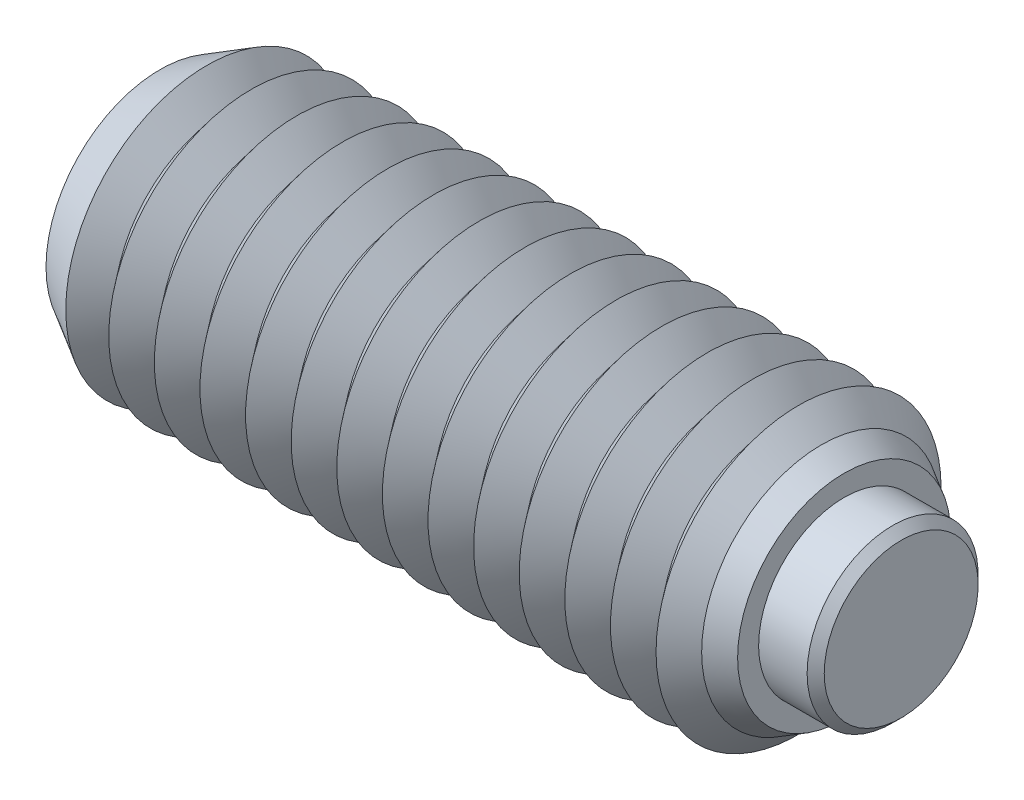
ISO-10303-21;
HEADER;
FILE_DESCRIPTION(('STEP AP214'),'2;1');
FILE_NAME('part.step','',(''),(''),'','','');
FILE_SCHEMA(('AUTOMOTIVE_DESIGN { 1 0 10303 214 1 1 1 1 }'));
ENDSEC;
DATA;
#1=APPLICATION_CONTEXT('core data for automotive mechanical design processes');
#2=APPLICATION_PROTOCOL_DEFINITION('international standard','automotive_design',2000,#1);
#3=PRODUCT_CONTEXT('',#1,'mechanical');
#4=PRODUCT('Part','Part','',(#3));
#5=PRODUCT_RELATED_PRODUCT_CATEGORY('part','',(#4));
#6=PRODUCT_DEFINITION_FORMATION('','',#4);
#7=PRODUCT_DEFINITION_CONTEXT('part definition',#1,'design');
#8=PRODUCT_DEFINITION('design','',#6,#7);
#9=PRODUCT_DEFINITION_SHAPE('','',#8);
#10=(LENGTH_UNIT() NAMED_UNIT(*) SI_UNIT(.MILLI.,.METRE.));
#11=(NAMED_UNIT(*) PLANE_ANGLE_UNIT() SI_UNIT($,.RADIAN.));
#12=(NAMED_UNIT(*) SI_UNIT($,.STERADIAN.) SOLID_ANGLE_UNIT());
#13=UNCERTAINTY_MEASURE_WITH_UNIT(LENGTH_MEASURE(1.E-05),#10,'distance_accuracy_value','');
#14=(GEOMETRIC_REPRESENTATION_CONTEXT(3) GLOBAL_UNCERTAINTY_ASSIGNED_CONTEXT((#13)) GLOBAL_UNIT_ASSIGNED_CONTEXT((#10,
#11,#12)) REPRESENTATION_CONTEXT('',''));
#15=CARTESIAN_POINT('',(0.,0.,0.));
#16=DIRECTION('',(0.,0.,1.));
#17=DIRECTION('',(1.,0.,0.));
#18=AXIS2_PLACEMENT_3D('',#15,#16,#17);
#19=CARTESIAN_POINT('',(1.4,0.,0.));
#20=DIRECTION('',(-1.,0.,0.));
#21=DIRECTION('',(0.,0.,1.));
#22=AXIS2_PLACEMENT_3D('',#19,#20,#21);
#23=CYLINDRICAL_SURFACE('',#22,1.5);
#24=CARTESIAN_POINT('',(1.25,0.,0.));
#25=DIRECTION('',(1.,0.,0.));
#26=DIRECTION('',(0.,0.,-1.));
#27=AXIS2_PLACEMENT_3D('',#24,#25,#26);
#28=CIRCLE('',#27,1.5);
#29=CARTESIAN_POINT('',(1.25,0.,1.5));
#30=VERTEX_POINT('',#29);
#31=EDGE_CURVE('P0_E10',#30,#30,#28,.F.);
#32=ORIENTED_EDGE('',*,*,#31,.T.);
#33=EDGE_LOOP('',(#32));
#34=FACE_BOUND('',#33,.T.);
#35=CARTESIAN_POINT('',(-0.6,0.,0.));
#36=DIRECTION('',(1.,0.,0.));
#37=DIRECTION('',(0.,0.,-1.));
#38=AXIS2_PLACEMENT_3D('',#35,#36,#37);
#39=CIRCLE('',#38,1.5);
#40=CARTESIAN_POINT('',(-0.6,0.,-1.5));
#41=VERTEX_POINT('',#40);
#42=EDGE_CURVE('P0_E25',#41,#41,#39,.T.);
#43=ORIENTED_EDGE('',*,*,#42,.T.);
#44=EDGE_LOOP('',(#43));
#45=FACE_BOUND('',#44,.T.);
#46=ADVANCED_FACE('P0_F14',(#34,#45),#23,.T.);
#47=CARTESIAN_POINT('',(1.4,0.,0.));
#48=DIRECTION('',(1.,0.,0.));
#49=DIRECTION('',(0.,0.,-1.));
#50=AXIS2_PLACEMENT_3D('',#47,#48,#49);
#51=PLANE('',#50);
#52=CARTESIAN_POINT('',(1.4,0.,0.));
#53=DIRECTION('',(1.,0.,0.));
#54=DIRECTION('',(0.,0.,-1.));
#55=AXIS2_PLACEMENT_3D('',#52,#53,#54);
#56=CIRCLE('',#55,1.35);
#57=CARTESIAN_POINT('',(1.4,0.,1.35));
#58=VERTEX_POINT('',#57);
#59=EDGE_CURVE('P0_E21',#58,#58,#56,.T.);
#60=ORIENTED_EDGE('',*,*,#59,.T.);
#61=EDGE_LOOP('',(#60));
#62=FACE_BOUND('',#61,.T.);
#63=ADVANCED_FACE('P0_F35',(#62),#51,.T.);
#64=CARTESIAN_POINT('',(-0.6,0.,0.));
#65=DIRECTION('',(1.,0.,0.));
#66=DIRECTION('',(0.,0.,-1.));
#67=AXIS2_PLACEMENT_3D('',#64,#65,#66);
#68=PLANE('',#67);
#69=ORIENTED_EDGE('',*,*,#42,.F.);
#70=EDGE_LOOP('',(#69));
#71=FACE_BOUND('',#70,.T.);
#72=ADVANCED_FACE('P0_F33',(#71),#68,.F.);
#73=CARTESIAN_POINT('',(1.4,0.,0.));
#74=DIRECTION('',(-1.,0.,0.));
#75=DIRECTION('',(0.,0.,1.));
#76=AXIS2_PLACEMENT_3D('',#73,#74,#75);
#77=CONICAL_SURFACE('',#76,1.35,0.785398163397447);
#78=CARTESIAN_POINT('',(1.25,0.,1.5));
#79=CARTESIAN_POINT('',(1.2515625,0.,1.4984375));
#80=CARTESIAN_POINT('',(1.253125,0.,1.496875));
#81=CARTESIAN_POINT('',(1.25625,0.,1.49375));
#82=CARTESIAN_POINT('',(1.2578125,0.,1.4921875));
#83=CARTESIAN_POINT('',(1.2609375,0.,1.4890625));
#84=CARTESIAN_POINT('',(1.2625,0.,1.4875));
#85=CARTESIAN_POINT('',(1.265625,0.,1.484375));
#86=CARTESIAN_POINT('',(1.2671875,0.,1.4828125));
#87=CARTESIAN_POINT('',(1.2703125,0.,1.4796875));
#88=CARTESIAN_POINT('',(1.271875,0.,1.478125));
#89=CARTESIAN_POINT('',(1.275,0.,1.475));
#90=CARTESIAN_POINT('',(1.2765625,0.,1.4734375));
#91=CARTESIAN_POINT('',(1.2796875,0.,1.4703125));
#92=CARTESIAN_POINT('',(1.28125,0.,1.46875));
#93=CARTESIAN_POINT('',(1.284375,0.,1.465625));
#94=CARTESIAN_POINT('',(1.2859375,0.,1.4640625));
#95=CARTESIAN_POINT('',(1.2890625,0.,1.4609375));
#96=CARTESIAN_POINT('',(1.290625,0.,1.459375));
#97=CARTESIAN_POINT('',(1.29375,0.,1.45625));
#98=CARTESIAN_POINT('',(1.2953125,0.,1.4546875));
#99=CARTESIAN_POINT('',(1.2984375,0.,1.4515625));
#100=CARTESIAN_POINT('',(1.3,0.,1.45));
#101=CARTESIAN_POINT('',(1.303125,0.,1.446875));
#102=CARTESIAN_POINT('',(1.3046875,0.,1.4453125));
#103=CARTESIAN_POINT('',(1.3078125,0.,1.4421875));
#104=CARTESIAN_POINT('',(1.309375,0.,1.440625));
#105=CARTESIAN_POINT('',(1.3125,0.,1.4375));
#106=CARTESIAN_POINT('',(1.3140625,0.,1.4359375));
#107=CARTESIAN_POINT('',(1.3171875,0.,1.4328125));
#108=CARTESIAN_POINT('',(1.31875,0.,1.43125));
#109=CARTESIAN_POINT('',(1.321875,0.,1.428125));
#110=CARTESIAN_POINT('',(1.3234375,0.,1.4265625));
#111=CARTESIAN_POINT('',(1.3265625,0.,1.4234375));
#112=CARTESIAN_POINT('',(1.328125,0.,1.421875));
#113=CARTESIAN_POINT('',(1.33125,0.,1.41875));
#114=CARTESIAN_POINT('',(1.3328125,0.,1.4171875));
#115=CARTESIAN_POINT('',(1.3359375,0.,1.4140625));
#116=CARTESIAN_POINT('',(1.3375,0.,1.4125));
#117=CARTESIAN_POINT('',(1.340625,0.,1.409375));
#118=CARTESIAN_POINT('',(1.3421875,0.,1.4078125));
#119=CARTESIAN_POINT('',(1.3453125,0.,1.4046875));
#120=CARTESIAN_POINT('',(1.346875,0.,1.403125));
#121=CARTESIAN_POINT('',(1.35,0.,1.4));
#122=CARTESIAN_POINT('',(1.3515625,0.,1.3984375));
#123=CARTESIAN_POINT('',(1.3546875,0.,1.3953125));
#124=CARTESIAN_POINT('',(1.35625,0.,1.39375));
#125=CARTESIAN_POINT('',(1.359375,0.,1.390625));
#126=CARTESIAN_POINT('',(1.3609375,0.,1.3890625));
#127=CARTESIAN_POINT('',(1.3640625,0.,1.3859375));
#128=CARTESIAN_POINT('',(1.365625,0.,1.384375));
#129=CARTESIAN_POINT('',(1.36875,0.,1.38125));
#130=CARTESIAN_POINT('',(1.3703125,0.,1.3796875));
#131=CARTESIAN_POINT('',(1.3734375,0.,1.3765625));
#132=CARTESIAN_POINT('',(1.375,0.,1.375));
#133=CARTESIAN_POINT('',(1.378125,0.,1.371875));
#134=CARTESIAN_POINT('',(1.3796875,0.,1.3703125));
#135=CARTESIAN_POINT('',(1.3828125,0.,1.3671875));
#136=CARTESIAN_POINT('',(1.384375,0.,1.365625));
#137=CARTESIAN_POINT('',(1.3875,0.,1.3625));
#138=CARTESIAN_POINT('',(1.3890625,0.,1.3609375));
#139=CARTESIAN_POINT('',(1.3921875,0.,1.3578125));
#140=CARTESIAN_POINT('',(1.39375,0.,1.35625));
#141=CARTESIAN_POINT('',(1.396875,0.,1.353125));
#142=CARTESIAN_POINT('',(1.3984375,0.,1.3515625));
#143=CARTESIAN_POINT('',(1.4,0.,1.35));
#144=B_SPLINE_CURVE_WITH_KNOTS('',3,(#78,#79,#80,#81,#82,#83,#84,#85,#86,#87,#88,#89,#90,#91,
#92,#93,#94,#95,#96,#97,#98,#99,#100,#101,#102,#103,#104,#105,#106,#107,#108,#109,#110,#111,
#112,#113,#114,#115,#116,#117,#118,#119,#120,#121,#122,#123,#124,#125,#126,#127,#128,#129,#130,
#131,#132,#133,#134,#135,#136,#137,#138,#139,#140,#141,#142,#143),.UNSPECIFIED.,.F.,.F.,(4,2,2,
2,2,2,2,2,2,2,2,2,2,2,2,2,2,2,2,2,2,2,2,2,2,2,2,2,2,2,2,2,4),(0.,0.00662912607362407,
0.0132582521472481,0.0198873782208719,0.0265165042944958,0.0331456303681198,0.0397747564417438,
0.0464038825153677,0.0530330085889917,0.0596621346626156,0.0662912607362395,0.0729203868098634,
0.0795495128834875,0.0861786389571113,0.0928077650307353,0.0994368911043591,0.106066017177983,
0.112695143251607,0.119324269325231,0.125953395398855,0.132582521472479,0.139211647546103,
0.145840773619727,0.152469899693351,0.159099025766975,0.165728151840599,0.172357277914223,
0.178986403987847,0.18561553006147,0.192244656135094,0.198873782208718,0.205502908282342,
0.212132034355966),.UNSPECIFIED.);
#145=EDGE_CURVE('P0_BSEAM16',#30,#58,#144,.T.);
#146=ORIENTED_EDGE('',*,*,#31,.F.);
#147=ORIENTED_EDGE('',*,*,#59,.F.);
#148=ORIENTED_EDGE('',*,*,#145,.T.);
#149=ORIENTED_EDGE('',*,*,#145,.F.);
#150=EDGE_LOOP('',(#146,#148,#147,#149));
#151=FACE_BOUND('',#150,.T.);
#152=ADVANCED_FACE('P0_F16',(#151),#77,.T.);
#153=CLOSED_SHELL('',(#46,#63,#72,#152));
#154=MANIFOLD_SOLID_BREP('P0_B1',#153);
#155=CARTESIAN_POINT('',(-10.8,0.,0.));
#156=DIRECTION('',(-1.,0.,0.));
#157=DIRECTION('',(0.,0.,1.));
#158=AXIS2_PLACEMENT_3D('',#155,#156,#157);
#159=CONICAL_SURFACE('',#158,2.5,0.895664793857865);
#160=CARTESIAN_POINT('',(-10.4,0.,0.));
#161=DIRECTION('',(1.,0.,0.));
#162=DIRECTION('',(0.,0.,-1.));
#163=AXIS2_PLACEMENT_3D('',#160,#161,#162);
#164=CIRCLE('',#163,2.00040016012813);
#165=CARTESIAN_POINT('',(-10.4,0.,-2.00040016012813));
#166=VERTEX_POINT('',#165);
#167=EDGE_CURVE('P1_E827',#166,#166,#164,.T.);
#168=ORIENTED_EDGE('',*,*,#167,.F.);
#169=EDGE_LOOP('',(#168));
#170=FACE_BOUND('',#169,.T.);
#171=CARTESIAN_POINT('',(-10.7793469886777,0.,0.));
#172=DIRECTION('',(1.,0.,0.));
#173=DIRECTION('',(0.,0.,-1.));
#174=AXIS2_PLACEMENT_3D('',#171,#172,#173);
#175=CIRCLE('',#174,2.47420439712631);
#176=CARTESIAN_POINT('',(-10.7793469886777,0.,-2.47420439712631));
#177=VERTEX_POINT('',#176);
#178=EDGE_CURVE('P1_E830',#177,#177,#175,.F.);
#179=ORIENTED_EDGE('',*,*,#178,.F.);
#180=EDGE_LOOP('',(#179));
#181=FACE_BOUND('',#180,.T.);
#182=ADVANCED_FACE('P1_F15',(#170,#181),#159,.T.);
#183=CARTESIAN_POINT('',(-0.799999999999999,0.,0.));
#184=DIRECTION('',(1.,0.,0.));
#185=DIRECTION('',(0.,0.,-1.));
#186=AXIS2_PLACEMENT_3D('',#183,#184,#185);
#187=CONICAL_SURFACE('',#186,2.00040016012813,0.895664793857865);
#188=CARTESIAN_POINT('',(-0.399999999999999,0.,0.));
#189=DIRECTION('',(1.,0.,0.));
#190=DIRECTION('',(0.,0.,-1.));
#191=AXIS2_PLACEMENT_3D('',#188,#189,#190);
#192=CIRCLE('',#191,2.5);
#193=CARTESIAN_POINT('',(-0.399999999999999,0.,2.5));
#194=VERTEX_POINT('',#193);
#195=EDGE_CURVE('P1_E751',#194,#194,#192,.T.);
#196=ORIENTED_EDGE('',*,*,#195,.F.);
#197=EDGE_LOOP('',(#196));
#198=FACE_BOUND('',#197,.T.);
#199=CARTESIAN_POINT('',(-0.799999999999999,0.,0.));
#200=DIRECTION('',(1.,0.,0.));
#201=DIRECTION('',(0.,0.,-1.));
#202=AXIS2_PLACEMENT_3D('',#199,#200,#201);
#203=CIRCLE('',#202,2.00040016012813);
#204=CARTESIAN_POINT('',(-0.799999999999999,0.,-2.00040016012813));
#205=VERTEX_POINT('',#204);
#206=EDGE_CURVE('P1_E752',#205,#205,#203,.T.);
#207=ORIENTED_EDGE('',*,*,#206,.T.);
#208=EDGE_LOOP('',(#207));
#209=FACE_BOUND('',#208,.T.);
#210=ADVANCED_FACE('P1_F222',(#198,#209),#187,.T.);
#211=CARTESIAN_POINT('',(-1.2,0.,0.));
#212=DIRECTION('',(-1.,0.,0.));
#213=DIRECTION('',(0.,0.,1.));
#214=AXIS2_PLACEMENT_3D('',#211,#212,#213);
#215=CONICAL_SURFACE('',#214,2.5,0.895664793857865);
#216=ORIENTED_EDGE('',*,*,#206,.F.);
#217=EDGE_LOOP('',(#216));
#218=FACE_BOUND('',#217,.T.);
#219=CARTESIAN_POINT('',(-1.2,0.,0.));
#220=DIRECTION('',(1.,0.,0.));
#221=DIRECTION('',(0.,0.,-1.));
#222=AXIS2_PLACEMENT_3D('',#219,#220,#221);
#223=CIRCLE('',#222,2.5);
#224=CARTESIAN_POINT('',(-1.2,0.,-2.5));
#225=VERTEX_POINT('',#224);
#226=EDGE_CURVE('P1_E756',#225,#225,#223,.T.);
#227=ORIENTED_EDGE('',*,*,#226,.T.);
#228=EDGE_LOOP('',(#227));
#229=FACE_BOUND('',#228,.T.);
#230=ADVANCED_FACE('P1_F227',(#218,#229),#215,.T.);
#231=CARTESIAN_POINT('',(-0.6,0.,0.));
#232=DIRECTION('',(1.,0.,0.));
#233=DIRECTION('',(0.,1.,0.));
#234=AXIS2_PLACEMENT_3D('',#231,#232,#233);
#235=PLANE('',#234);
#236=CARTESIAN_POINT('',(-0.6,0.,0.));
#237=DIRECTION('',(1.,0.,0.));
#238=DIRECTION('',(0.,1.,0.));
#239=AXIS2_PLACEMENT_3D('',#236,#237,#238);
#240=CIRCLE('',#239,1.5);
#241=CARTESIAN_POINT('',(-0.6,1.5,0.));
#242=VERTEX_POINT('',#241);
#243=EDGE_CURVE('P1_E398',#242,#242,#240,.T.);
#244=ORIENTED_EDGE('',*,*,#243,.T.);
#245=EDGE_LOOP('',(#244));
#246=FACE_BOUND('',#245,.T.);
#247=ADVANCED_FACE('P1_F325',(#246),#235,.T.);
#248=CARTESIAN_POINT('',(-0.6,0.,0.));
#249=DIRECTION('',(1.,0.,0.));
#250=DIRECTION('',(0.,1.,0.));
#251=AXIS2_PLACEMENT_3D('',#248,#249,#250);
#252=CYLINDRICAL_SURFACE('',#251,1.5);
#253=ORIENTED_EDGE('',*,*,#243,.F.);
#254=EDGE_LOOP('',(#253));
#255=FACE_BOUND('',#254,.T.);
#256=CARTESIAN_POINT('',(0.4,0.,0.));
#257=DIRECTION('',(1.,0.,0.));
#258=DIRECTION('',(0.,1.,0.));
#259=AXIS2_PLACEMENT_3D('',#256,#257,#258);
#260=CIRCLE('',#259,1.5);
#261=CARTESIAN_POINT('',(0.4,1.5,0.));
#262=VERTEX_POINT('',#261);
#263=EDGE_CURVE('P1_E401',#262,#262,#260,.T.);
#264=ORIENTED_EDGE('',*,*,#263,.T.);
#265=EDGE_LOOP('',(#264));
#266=FACE_BOUND('',#265,.T.);
#267=ADVANCED_FACE('P1_F209',(#255,#266),#252,.F.);
#268=CARTESIAN_POINT('',(0.4,1.86905989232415,0.));
#269=DIRECTION('',(1.,0.,0.));
#270=DIRECTION('',(0.,1.,0.));
#271=AXIS2_PLACEMENT_3D('',#268,#269,#270);
#272=PLANE('',#271);
#273=ORIENTED_EDGE('',*,*,#263,.F.);
#274=EDGE_LOOP('',(#273));
#275=FACE_BOUND('',#274,.T.);
#276=CARTESIAN_POINT('',(0.4,0.,0.));
#277=DIRECTION('',(1.,0.,0.));
#278=DIRECTION('',(0.,1.,0.));
#279=AXIS2_PLACEMENT_3D('',#276,#277,#278);
#280=CIRCLE('',#279,1.86905989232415);
#281=CARTESIAN_POINT('',(0.4,1.86905989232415,0.));
#282=VERTEX_POINT('',#281);
#283=EDGE_CURVE('P1_E121',#282,#282,#280,.T.);
#284=ORIENTED_EDGE('',*,*,#283,.T.);
#285=EDGE_LOOP('',(#284));
#286=FACE_BOUND('',#285,.T.);
#287=ADVANCED_FACE('P1_F206',(#275,#286),#272,.T.);
#288=CARTESIAN_POINT('',(0.4,0.,0.));
#289=DIRECTION('',(-1.,0.,0.));
#290=DIRECTION('',(0.,-1.,0.));
#291=AXIS2_PLACEMENT_3D('',#288,#289,#290);
#292=CONICAL_SURFACE('',#291,1.86905989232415,0.523598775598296);
#293=CARTESIAN_POINT('',(0.,0.,0.));
#294=DIRECTION('',(1.,0.,0.));
#295=DIRECTION('',(0.,0.,-1.));
#296=AXIS2_PLACEMENT_3D('',#293,#294,#295);
#297=CIRCLE('',#296,2.1);
#298=CARTESIAN_POINT('',(0.,0.,2.1));
#299=VERTEX_POINT('',#298);
#300=EDGE_CURVE('P1_E389',#299,#299,#297,.T.);
#301=ORIENTED_EDGE('',*,*,#300,.T.);
#302=EDGE_LOOP('',(#301));
#303=FACE_BOUND('',#302,.T.);
#304=ORIENTED_EDGE('',*,*,#283,.F.);
#305=EDGE_LOOP('',(#304));
#306=FACE_BOUND('',#305,.T.);
#307=ADVANCED_FACE('P1_F203',(#303,#306),#292,.T.);
#308=CARTESIAN_POINT('',(0.,0.,0.));
#309=DIRECTION('',(-1.,0.,0.));
#310=DIRECTION('',(0.,0.,1.));
#311=AXIS2_PLACEMENT_3D('',#308,#309,#310);
#312=CONICAL_SURFACE('',#311,2.1,0.785398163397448);
#313=CARTESIAN_POINT('',(-0.399999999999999,0.,2.5));
#314=CARTESIAN_POINT('',(-0.395833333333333,0.,2.49583333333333));
#315=CARTESIAN_POINT('',(-0.391666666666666,0.,2.49166666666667));
#316=CARTESIAN_POINT('',(-0.383333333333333,0.,2.48333333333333));
#317=CARTESIAN_POINT('',(-0.379166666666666,0.,2.47916666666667));
#318=CARTESIAN_POINT('',(-0.370833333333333,0.,2.47083333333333));
#319=CARTESIAN_POINT('',(-0.366666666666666,0.,2.46666666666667));
#320=CARTESIAN_POINT('',(-0.358333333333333,0.,2.45833333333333));
#321=CARTESIAN_POINT('',(-0.354166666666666,0.,2.45416666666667));
#322=CARTESIAN_POINT('',(-0.345833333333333,0.,2.44583333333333));
#323=CARTESIAN_POINT('',(-0.341666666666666,0.,2.44166666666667));
#324=CARTESIAN_POINT('',(-0.333333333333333,0.,2.43333333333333));
#325=CARTESIAN_POINT('',(-0.329166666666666,0.,2.42916666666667));
#326=CARTESIAN_POINT('',(-0.320833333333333,0.,2.42083333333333));
#327=CARTESIAN_POINT('',(-0.316666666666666,0.,2.41666666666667));
#328=CARTESIAN_POINT('',(-0.308333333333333,0.,2.40833333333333));
#329=CARTESIAN_POINT('',(-0.304166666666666,0.,2.40416666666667));
#330=CARTESIAN_POINT('',(-0.295833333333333,0.,2.39583333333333));
#331=CARTESIAN_POINT('',(-0.291666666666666,0.,2.39166666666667));
#332=CARTESIAN_POINT('',(-0.283333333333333,0.,2.38333333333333));
#333=CARTESIAN_POINT('',(-0.279166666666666,0.,2.37916666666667));
#334=CARTESIAN_POINT('',(-0.270833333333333,0.,2.37083333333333));
#335=CARTESIAN_POINT('',(-0.266666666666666,0.,2.36666666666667));
#336=CARTESIAN_POINT('',(-0.258333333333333,0.,2.35833333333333));
#337=CARTESIAN_POINT('',(-0.254166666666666,0.,2.35416666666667));
#338=CARTESIAN_POINT('',(-0.245833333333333,0.,2.34583333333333));
#339=CARTESIAN_POINT('',(-0.241666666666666,0.,2.34166666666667));
#340=CARTESIAN_POINT('',(-0.233333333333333,0.,2.33333333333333));
#341=CARTESIAN_POINT('',(-0.229166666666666,0.,2.32916666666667));
#342=CARTESIAN_POINT('',(-0.220833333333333,0.,2.32083333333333));
#343=CARTESIAN_POINT('',(-0.216666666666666,0.,2.31666666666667));
#344=CARTESIAN_POINT('',(-0.208333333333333,0.,2.30833333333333));
#345=CARTESIAN_POINT('',(-0.204166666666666,0.,2.30416666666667));
#346=CARTESIAN_POINT('',(-0.195833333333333,0.,2.29583333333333));
#347=CARTESIAN_POINT('',(-0.191666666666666,0.,2.29166666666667));
#348=CARTESIAN_POINT('',(-0.183333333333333,0.,2.28333333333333));
#349=CARTESIAN_POINT('',(-0.179166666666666,0.,2.27916666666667));
#350=CARTESIAN_POINT('',(-0.170833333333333,0.,2.27083333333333));
#351=CARTESIAN_POINT('',(-0.166666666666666,0.,2.26666666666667));
#352=CARTESIAN_POINT('',(-0.158333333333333,0.,2.25833333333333));
#353=CARTESIAN_POINT('',(-0.154166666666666,0.,2.25416666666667));
#354=CARTESIAN_POINT('',(-0.145833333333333,0.,2.24583333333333));
#355=CARTESIAN_POINT('',(-0.141666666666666,0.,2.24166666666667));
#356=CARTESIAN_POINT('',(-0.133333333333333,0.,2.23333333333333));
#357=CARTESIAN_POINT('',(-0.129166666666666,0.,2.22916666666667));
#358=CARTESIAN_POINT('',(-0.120833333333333,0.,2.22083333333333));
#359=CARTESIAN_POINT('',(-0.116666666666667,0.,2.21666666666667));
#360=CARTESIAN_POINT('',(-0.108333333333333,0.,2.20833333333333));
#361=CARTESIAN_POINT('',(-0.104166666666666,0.,2.20416666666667));
#362=CARTESIAN_POINT('',(-0.0958333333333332,0.,2.19583333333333));
#363=CARTESIAN_POINT('',(-0.0916666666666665,0.,2.19166666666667));
#364=CARTESIAN_POINT('',(-0.0833333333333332,0.,2.18333333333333));
#365=CARTESIAN_POINT('',(-0.0791666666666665,0.,2.17916666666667));
#366=CARTESIAN_POINT('',(-0.0708333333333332,0.,2.17083333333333));
#367=CARTESIAN_POINT('',(-0.0666666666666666,0.,2.16666666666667));
#368=CARTESIAN_POINT('',(-0.0583333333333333,0.,2.15833333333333));
#369=CARTESIAN_POINT('',(-0.0541666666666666,0.,2.15416666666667));
#370=CARTESIAN_POINT('',(-0.0458333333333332,0.,2.14583333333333));
#371=CARTESIAN_POINT('',(-0.0416666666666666,0.,2.14166666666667));
#372=CARTESIAN_POINT('',(-0.0333333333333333,0.,2.13333333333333));
#373=CARTESIAN_POINT('',(-0.0291666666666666,0.,2.12916666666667));
#374=CARTESIAN_POINT('',(-0.0208333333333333,0.,2.12083333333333));
#375=CARTESIAN_POINT('',(-0.0166666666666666,0.,2.11666666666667));
#376=CARTESIAN_POINT('',(-0.00833333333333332,0.,2.10833333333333));
#377=CARTESIAN_POINT('',(-0.00416666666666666,0.,2.10416666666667));
#378=CARTESIAN_POINT('',(0.,0.,2.1));
#379=B_SPLINE_CURVE_WITH_KNOTS('',3,(#313,#314,#315,#316,#317,#318,#319,#320,#321,#322,#323,
#324,#325,#326,#327,#328,#329,#330,#331,#332,#333,#334,#335,#336,#337,#338,#339,#340,#341,#342,
#343,#344,#345,#346,#347,#348,#349,#350,#351,#352,#353,#354,#355,#356,#357,#358,#359,#360,#361,
#362,#363,#364,#365,#366,#367,#368,#369,#370,#371,#372,#373,#374,#375,#376,#377,#378),
.UNSPECIFIED.,.F.,.F.,(4,2,2,2,2,2,2,2,2,2,2,2,2,2,2,2,2,2,2,2,2,2,2,2,2,2,2,2,2,2,2,2,4),(0.,
0.0176776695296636,0.0353553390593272,0.0530330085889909,0.0707106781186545,0.0883883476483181,
0.106066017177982,0.123743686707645,0.141421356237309,0.159099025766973,0.176776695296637,
0.1944543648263,0.212132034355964,0.229809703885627,0.247487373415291,0.265165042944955,
0.282842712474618,0.300520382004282,0.318198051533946,0.335875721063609,0.353553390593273,
0.371231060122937,0.3889087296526,0.406586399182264,0.424264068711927,0.441941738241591,
0.459619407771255,0.477297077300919,0.494974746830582,0.512652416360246,0.530330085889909,
0.548007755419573,0.565685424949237),.UNSPECIFIED.);
#380=EDGE_CURVE('P1_BSEAM17',#194,#299,#379,.T.);
#381=ORIENTED_EDGE('',*,*,#195,.T.);
#382=ORIENTED_EDGE('',*,*,#300,.F.);
#383=ORIENTED_EDGE('',*,*,#380,.T.);
#384=ORIENTED_EDGE('',*,*,#380,.F.);
#385=EDGE_LOOP('',(#381,#383,#382,#384));
#386=FACE_BOUND('',#385,.T.);
#387=ADVANCED_FACE('P1_F17',(#386),#312,.T.);
#388=CARTESIAN_POINT('',(-1.6,0.,0.));
#389=DIRECTION('',(1.,0.,0.));
#390=DIRECTION('',(0.,0.,-1.));
#391=AXIS2_PLACEMENT_3D('',#388,#389,#390);
#392=CONICAL_SURFACE('',#391,2.00040016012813,0.895664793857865);
#393=ORIENTED_EDGE('',*,*,#226,.F.);
#394=EDGE_LOOP('',(#393));
#395=FACE_BOUND('',#394,.T.);
#396=CARTESIAN_POINT('',(-1.6,0.,0.));
#397=DIRECTION('',(1.,0.,0.));
#398=DIRECTION('',(0.,0.,-1.));
#399=AXIS2_PLACEMENT_3D('',#396,#397,#398);
#400=CIRCLE('',#399,2.00040016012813);
#401=CARTESIAN_POINT('',(-1.6,0.,-2.00040016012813));
#402=VERTEX_POINT('',#401);
#403=EDGE_CURVE('P1_E761',#402,#402,#400,.T.);
#404=ORIENTED_EDGE('',*,*,#403,.T.);
#405=EDGE_LOOP('',(#404));
#406=FACE_BOUND('',#405,.T.);
#407=ADVANCED_FACE('P1_F319',(#395,#406),#392,.T.);
#408=CARTESIAN_POINT('',(-2.,0.,0.));
#409=DIRECTION('',(-1.,0.,0.));
#410=DIRECTION('',(0.,0.,1.));
#411=AXIS2_PLACEMENT_3D('',#408,#409,#410);
#412=CONICAL_SURFACE('',#411,2.5,0.895664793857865);
#413=ORIENTED_EDGE('',*,*,#403,.F.);
#414=EDGE_LOOP('',(#413));
#415=FACE_BOUND('',#414,.T.);
#416=CARTESIAN_POINT('',(-2.,0.,0.));
#417=DIRECTION('',(1.,0.,0.));
#418=DIRECTION('',(0.,0.,-1.));
#419=AXIS2_PLACEMENT_3D('',#416,#417,#418);
#420=CIRCLE('',#419,2.5);
#421=CARTESIAN_POINT('',(-2.,0.,-2.5));
#422=VERTEX_POINT('',#421);
#423=EDGE_CURVE('P1_E764',#422,#422,#420,.T.);
#424=ORIENTED_EDGE('',*,*,#423,.T.);
#425=EDGE_LOOP('',(#424));
#426=FACE_BOUND('',#425,.T.);
#427=ADVANCED_FACE('P1_F315',(#415,#426),#412,.T.);
#428=CARTESIAN_POINT('',(-2.4,0.,0.));
#429=DIRECTION('',(1.,0.,0.));
#430=DIRECTION('',(0.,0.,-1.));
#431=AXIS2_PLACEMENT_3D('',#428,#429,#430);
#432=CONICAL_SURFACE('',#431,2.00040016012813,0.895664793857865);
#433=ORIENTED_EDGE('',*,*,#423,.F.);
#434=EDGE_LOOP('',(#433));
#435=FACE_BOUND('',#434,.T.);
#436=CARTESIAN_POINT('',(-2.4,0.,0.));
#437=DIRECTION('',(1.,0.,0.));
#438=DIRECTION('',(0.,0.,-1.));
#439=AXIS2_PLACEMENT_3D('',#436,#437,#438);
#440=CIRCLE('',#439,2.00040016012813);
#441=CARTESIAN_POINT('',(-2.4,0.,-2.00040016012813));
#442=VERTEX_POINT('',#441);
#443=EDGE_CURVE('P1_E767',#442,#442,#440,.T.);
#444=ORIENTED_EDGE('',*,*,#443,.T.);
#445=EDGE_LOOP('',(#444));
#446=FACE_BOUND('',#445,.T.);
#447=ADVANCED_FACE('P1_F311',(#435,#446),#432,.T.);
#448=CARTESIAN_POINT('',(-2.8,0.,0.));
#449=DIRECTION('',(-1.,0.,0.));
#450=DIRECTION('',(0.,0.,1.));
#451=AXIS2_PLACEMENT_3D('',#448,#449,#450);
#452=CONICAL_SURFACE('',#451,2.5,0.895664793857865);
#453=ORIENTED_EDGE('',*,*,#443,.F.);
#454=EDGE_LOOP('',(#453));
#455=FACE_BOUND('',#454,.T.);
#456=CARTESIAN_POINT('',(-2.8,0.,0.));
#457=DIRECTION('',(1.,0.,0.));
#458=DIRECTION('',(0.,0.,-1.));
#459=AXIS2_PLACEMENT_3D('',#456,#457,#458);
#460=CIRCLE('',#459,2.5);
#461=CARTESIAN_POINT('',(-2.8,0.,-2.5));
#462=VERTEX_POINT('',#461);
#463=EDGE_CURVE('P1_E770',#462,#462,#460,.T.);
#464=ORIENTED_EDGE('',*,*,#463,.T.);
#465=EDGE_LOOP('',(#464));
#466=FACE_BOUND('',#465,.T.);
#467=ADVANCED_FACE('P1_F307',(#455,#466),#452,.T.);
#468=CARTESIAN_POINT('',(-3.2,0.,0.));
#469=DIRECTION('',(1.,0.,0.));
#470=DIRECTION('',(0.,0.,-1.));
#471=AXIS2_PLACEMENT_3D('',#468,#469,#470);
#472=CONICAL_SURFACE('',#471,2.00040016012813,0.895664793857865);
#473=ORIENTED_EDGE('',*,*,#463,.F.);
#474=EDGE_LOOP('',(#473));
#475=FACE_BOUND('',#474,.T.);
#476=CARTESIAN_POINT('',(-3.2,0.,0.));
#477=DIRECTION('',(1.,0.,0.));
#478=DIRECTION('',(0.,0.,-1.));
#479=AXIS2_PLACEMENT_3D('',#476,#477,#478);
#480=CIRCLE('',#479,2.00040016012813);
#481=CARTESIAN_POINT('',(-3.2,0.,-2.00040016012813));
#482=VERTEX_POINT('',#481);
#483=EDGE_CURVE('P1_E773',#482,#482,#480,.T.);
#484=ORIENTED_EDGE('',*,*,#483,.T.);
#485=EDGE_LOOP('',(#484));
#486=FACE_BOUND('',#485,.T.);
#487=ADVANCED_FACE('P1_F303',(#475,#486),#472,.T.);
#488=CARTESIAN_POINT('',(-3.6,0.,0.));
#489=DIRECTION('',(-1.,0.,0.));
#490=DIRECTION('',(0.,0.,1.));
#491=AXIS2_PLACEMENT_3D('',#488,#489,#490);
#492=CONICAL_SURFACE('',#491,2.5,0.895664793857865);
#493=ORIENTED_EDGE('',*,*,#483,.F.);
#494=EDGE_LOOP('',(#493));
#495=FACE_BOUND('',#494,.T.);
#496=CARTESIAN_POINT('',(-3.6,0.,0.));
#497=DIRECTION('',(1.,0.,0.));
#498=DIRECTION('',(0.,0.,-1.));
#499=AXIS2_PLACEMENT_3D('',#496,#497,#498);
#500=CIRCLE('',#499,2.5);
#501=CARTESIAN_POINT('',(-3.6,0.,-2.5));
#502=VERTEX_POINT('',#501);
#503=EDGE_CURVE('P1_E776',#502,#502,#500,.T.);
#504=ORIENTED_EDGE('',*,*,#503,.T.);
#505=EDGE_LOOP('',(#504));
#506=FACE_BOUND('',#505,.T.);
#507=ADVANCED_FACE('P1_F299',(#495,#506),#492,.T.);
#508=CARTESIAN_POINT('',(-4.,0.,0.));
#509=DIRECTION('',(1.,0.,0.));
#510=DIRECTION('',(0.,0.,-1.));
#511=AXIS2_PLACEMENT_3D('',#508,#509,#510);
#512=CONICAL_SURFACE('',#511,2.00040016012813,0.895664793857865);
#513=ORIENTED_EDGE('',*,*,#503,.F.);
#514=EDGE_LOOP('',(#513));
#515=FACE_BOUND('',#514,.T.);
#516=CARTESIAN_POINT('',(-4.,0.,0.));
#517=DIRECTION('',(1.,0.,0.));
#518=DIRECTION('',(0.,0.,-1.));
#519=AXIS2_PLACEMENT_3D('',#516,#517,#518);
#520=CIRCLE('',#519,2.00040016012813);
#521=CARTESIAN_POINT('',(-4.,0.,-2.00040016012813));
#522=VERTEX_POINT('',#521);
#523=EDGE_CURVE('P1_E779',#522,#522,#520,.T.);
#524=ORIENTED_EDGE('',*,*,#523,.T.);
#525=EDGE_LOOP('',(#524));
#526=FACE_BOUND('',#525,.T.);
#527=ADVANCED_FACE('P1_F295',(#515,#526),#512,.T.);
#528=CARTESIAN_POINT('',(-4.4,0.,0.));
#529=DIRECTION('',(-1.,0.,0.));
#530=DIRECTION('',(0.,0.,1.));
#531=AXIS2_PLACEMENT_3D('',#528,#529,#530);
#532=CONICAL_SURFACE('',#531,2.5,0.895664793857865);
#533=ORIENTED_EDGE('',*,*,#523,.F.);
#534=EDGE_LOOP('',(#533));
#535=FACE_BOUND('',#534,.T.);
#536=CARTESIAN_POINT('',(-4.4,0.,0.));
#537=DIRECTION('',(1.,0.,0.));
#538=DIRECTION('',(0.,0.,-1.));
#539=AXIS2_PLACEMENT_3D('',#536,#537,#538);
#540=CIRCLE('',#539,2.5);
#541=CARTESIAN_POINT('',(-4.4,0.,-2.5));
#542=VERTEX_POINT('',#541);
#543=EDGE_CURVE('P1_E782',#542,#542,#540,.T.);
#544=ORIENTED_EDGE('',*,*,#543,.T.);
#545=EDGE_LOOP('',(#544));
#546=FACE_BOUND('',#545,.T.);
#547=ADVANCED_FACE('P1_F291',(#535,#546),#532,.T.);
#548=CARTESIAN_POINT('',(-4.8,0.,0.));
#549=DIRECTION('',(1.,0.,0.));
#550=DIRECTION('',(0.,0.,-1.));
#551=AXIS2_PLACEMENT_3D('',#548,#549,#550);
#552=CONICAL_SURFACE('',#551,2.00040016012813,0.895664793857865);
#553=ORIENTED_EDGE('',*,*,#543,.F.);
#554=EDGE_LOOP('',(#553));
#555=FACE_BOUND('',#554,.T.);
#556=CARTESIAN_POINT('',(-4.8,0.,0.));
#557=DIRECTION('',(1.,0.,0.));
#558=DIRECTION('',(0.,0.,-1.));
#559=AXIS2_PLACEMENT_3D('',#556,#557,#558);
#560=CIRCLE('',#559,2.00040016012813);
#561=CARTESIAN_POINT('',(-4.8,0.,-2.00040016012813));
#562=VERTEX_POINT('',#561);
#563=EDGE_CURVE('P1_E785',#562,#562,#560,.T.);
#564=ORIENTED_EDGE('',*,*,#563,.T.);
#565=EDGE_LOOP('',(#564));
#566=FACE_BOUND('',#565,.T.);
#567=ADVANCED_FACE('P1_F287',(#555,#566),#552,.T.);
#568=CARTESIAN_POINT('',(-5.2,0.,0.));
#569=DIRECTION('',(-1.,0.,0.));
#570=DIRECTION('',(0.,0.,1.));
#571=AXIS2_PLACEMENT_3D('',#568,#569,#570);
#572=CONICAL_SURFACE('',#571,2.5,0.895664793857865);
#573=ORIENTED_EDGE('',*,*,#563,.F.);
#574=EDGE_LOOP('',(#573));
#575=FACE_BOUND('',#574,.T.);
#576=CARTESIAN_POINT('',(-5.2,0.,0.));
#577=DIRECTION('',(1.,0.,0.));
#578=DIRECTION('',(0.,0.,-1.));
#579=AXIS2_PLACEMENT_3D('',#576,#577,#578);
#580=CIRCLE('',#579,2.5);
#581=CARTESIAN_POINT('',(-5.2,0.,-2.5));
#582=VERTEX_POINT('',#581);
#583=EDGE_CURVE('P1_E788',#582,#582,#580,.T.);
#584=ORIENTED_EDGE('',*,*,#583,.T.);
#585=EDGE_LOOP('',(#584));
#586=FACE_BOUND('',#585,.T.);
#587=ADVANCED_FACE('P1_F283',(#575,#586),#572,.T.);
#588=CARTESIAN_POINT('',(-5.6,0.,0.));
#589=DIRECTION('',(1.,0.,0.));
#590=DIRECTION('',(0.,0.,-1.));
#591=AXIS2_PLACEMENT_3D('',#588,#589,#590);
#592=CONICAL_SURFACE('',#591,2.00040016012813,0.895664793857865);
#593=ORIENTED_EDGE('',*,*,#583,.F.);
#594=EDGE_LOOP('',(#593));
#595=FACE_BOUND('',#594,.T.);
#596=CARTESIAN_POINT('',(-5.6,0.,0.));
#597=DIRECTION('',(1.,0.,0.));
#598=DIRECTION('',(0.,0.,-1.));
#599=AXIS2_PLACEMENT_3D('',#596,#597,#598);
#600=CIRCLE('',#599,2.00040016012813);
#601=CARTESIAN_POINT('',(-5.6,0.,-2.00040016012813));
#602=VERTEX_POINT('',#601);
#603=EDGE_CURVE('P1_E791',#602,#602,#600,.T.);
#604=ORIENTED_EDGE('',*,*,#603,.T.);
#605=EDGE_LOOP('',(#604));
#606=FACE_BOUND('',#605,.T.);
#607=ADVANCED_FACE('P1_F279',(#595,#606),#592,.T.);
#608=CARTESIAN_POINT('',(-6.,0.,0.));
#609=DIRECTION('',(-1.,0.,0.));
#610=DIRECTION('',(0.,0.,1.));
#611=AXIS2_PLACEMENT_3D('',#608,#609,#610);
#612=CONICAL_SURFACE('',#611,2.5,0.895664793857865);
#613=ORIENTED_EDGE('',*,*,#603,.F.);
#614=EDGE_LOOP('',(#613));
#615=FACE_BOUND('',#614,.T.);
#616=CARTESIAN_POINT('',(-6.,0.,0.));
#617=DIRECTION('',(1.,0.,0.));
#618=DIRECTION('',(0.,0.,-1.));
#619=AXIS2_PLACEMENT_3D('',#616,#617,#618);
#620=CIRCLE('',#619,2.5);
#621=CARTESIAN_POINT('',(-6.,0.,-2.5));
#622=VERTEX_POINT('',#621);
#623=EDGE_CURVE('P1_E794',#622,#622,#620,.T.);
#624=ORIENTED_EDGE('',*,*,#623,.T.);
#625=EDGE_LOOP('',(#624));
#626=FACE_BOUND('',#625,.T.);
#627=ADVANCED_FACE('P1_F275',(#615,#626),#612,.T.);
#628=CARTESIAN_POINT('',(-6.4,0.,0.));
#629=DIRECTION('',(1.,0.,0.));
#630=DIRECTION('',(0.,0.,-1.));
#631=AXIS2_PLACEMENT_3D('',#628,#629,#630);
#632=CONICAL_SURFACE('',#631,2.00040016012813,0.895664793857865);
#633=ORIENTED_EDGE('',*,*,#623,.F.);
#634=EDGE_LOOP('',(#633));
#635=FACE_BOUND('',#634,.T.);
#636=CARTESIAN_POINT('',(-6.4,0.,0.));
#637=DIRECTION('',(1.,0.,0.));
#638=DIRECTION('',(0.,0.,-1.));
#639=AXIS2_PLACEMENT_3D('',#636,#637,#638);
#640=CIRCLE('',#639,2.00040016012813);
#641=CARTESIAN_POINT('',(-6.4,0.,-2.00040016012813));
#642=VERTEX_POINT('',#641);
#643=EDGE_CURVE('P1_E797',#642,#642,#640,.T.);
#644=ORIENTED_EDGE('',*,*,#643,.T.);
#645=EDGE_LOOP('',(#644));
#646=FACE_BOUND('',#645,.T.);
#647=ADVANCED_FACE('P1_F271',(#635,#646),#632,.T.);
#648=CARTESIAN_POINT('',(-6.8,0.,0.));
#649=DIRECTION('',(-1.,0.,0.));
#650=DIRECTION('',(0.,0.,1.));
#651=AXIS2_PLACEMENT_3D('',#648,#649,#650);
#652=CONICAL_SURFACE('',#651,2.5,0.895664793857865);
#653=ORIENTED_EDGE('',*,*,#643,.F.);
#654=EDGE_LOOP('',(#653));
#655=FACE_BOUND('',#654,.T.);
#656=CARTESIAN_POINT('',(-6.8,0.,0.));
#657=DIRECTION('',(1.,0.,0.));
#658=DIRECTION('',(0.,0.,-1.));
#659=AXIS2_PLACEMENT_3D('',#656,#657,#658);
#660=CIRCLE('',#659,2.5);
#661=CARTESIAN_POINT('',(-6.8,0.,-2.5));
#662=VERTEX_POINT('',#661);
#663=EDGE_CURVE('P1_E800',#662,#662,#660,.T.);
#664=ORIENTED_EDGE('',*,*,#663,.T.);
#665=EDGE_LOOP('',(#664));
#666=FACE_BOUND('',#665,.T.);
#667=ADVANCED_FACE('P1_F267',(#655,#666),#652,.T.);
#668=CARTESIAN_POINT('',(-7.2,0.,0.));
#669=DIRECTION('',(1.,0.,0.));
#670=DIRECTION('',(0.,0.,-1.));
#671=AXIS2_PLACEMENT_3D('',#668,#669,#670);
#672=CONICAL_SURFACE('',#671,2.00040016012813,0.895664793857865);
#673=ORIENTED_EDGE('',*,*,#663,.F.);
#674=EDGE_LOOP('',(#673));
#675=FACE_BOUND('',#674,.T.);
#676=CARTESIAN_POINT('',(-7.2,0.,0.));
#677=DIRECTION('',(1.,0.,0.));
#678=DIRECTION('',(0.,0.,-1.));
#679=AXIS2_PLACEMENT_3D('',#676,#677,#678);
#680=CIRCLE('',#679,2.00040016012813);
#681=CARTESIAN_POINT('',(-7.2,0.,-2.00040016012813));
#682=VERTEX_POINT('',#681);
#683=EDGE_CURVE('P1_E803',#682,#682,#680,.T.);
#684=ORIENTED_EDGE('',*,*,#683,.T.);
#685=EDGE_LOOP('',(#684));
#686=FACE_BOUND('',#685,.T.);
#687=ADVANCED_FACE('P1_F263',(#675,#686),#672,.T.);
#688=CARTESIAN_POINT('',(-7.6,0.,0.));
#689=DIRECTION('',(-1.,0.,0.));
#690=DIRECTION('',(0.,0.,1.));
#691=AXIS2_PLACEMENT_3D('',#688,#689,#690);
#692=CONICAL_SURFACE('',#691,2.5,0.895664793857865);
#693=ORIENTED_EDGE('',*,*,#683,.F.);
#694=EDGE_LOOP('',(#693));
#695=FACE_BOUND('',#694,.T.);
#696=CARTESIAN_POINT('',(-7.6,0.,0.));
#697=DIRECTION('',(1.,0.,0.));
#698=DIRECTION('',(0.,0.,-1.));
#699=AXIS2_PLACEMENT_3D('',#696,#697,#698);
#700=CIRCLE('',#699,2.5);
#701=CARTESIAN_POINT('',(-7.6,0.,-2.5));
#702=VERTEX_POINT('',#701);
#703=EDGE_CURVE('P1_E806',#702,#702,#700,.T.);
#704=ORIENTED_EDGE('',*,*,#703,.T.);
#705=EDGE_LOOP('',(#704));
#706=FACE_BOUND('',#705,.T.);
#707=ADVANCED_FACE('P1_F259',(#695,#706),#692,.T.);
#708=CARTESIAN_POINT('',(-8.,0.,0.));
#709=DIRECTION('',(1.,0.,0.));
#710=DIRECTION('',(0.,0.,-1.));
#711=AXIS2_PLACEMENT_3D('',#708,#709,#710);
#712=CONICAL_SURFACE('',#711,2.00040016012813,0.895664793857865);
#713=ORIENTED_EDGE('',*,*,#703,.F.);
#714=EDGE_LOOP('',(#713));
#715=FACE_BOUND('',#714,.T.);
#716=CARTESIAN_POINT('',(-8.,0.,0.));
#717=DIRECTION('',(1.,0.,0.));
#718=DIRECTION('',(0.,0.,-1.));
#719=AXIS2_PLACEMENT_3D('',#716,#717,#718);
#720=CIRCLE('',#719,2.00040016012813);
#721=CARTESIAN_POINT('',(-8.,0.,-2.00040016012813));
#722=VERTEX_POINT('',#721);
#723=EDGE_CURVE('P1_E809',#722,#722,#720,.T.);
#724=ORIENTED_EDGE('',*,*,#723,.T.);
#725=EDGE_LOOP('',(#724));
#726=FACE_BOUND('',#725,.T.);
#727=ADVANCED_FACE('P1_F255',(#715,#726),#712,.T.);
#728=CARTESIAN_POINT('',(-8.4,0.,0.));
#729=DIRECTION('',(-1.,0.,0.));
#730=DIRECTION('',(0.,0.,1.));
#731=AXIS2_PLACEMENT_3D('',#728,#729,#730);
#732=CONICAL_SURFACE('',#731,2.5,0.895664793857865);
#733=ORIENTED_EDGE('',*,*,#723,.F.);
#734=EDGE_LOOP('',(#733));
#735=FACE_BOUND('',#734,.T.);
#736=CARTESIAN_POINT('',(-8.4,0.,0.));
#737=DIRECTION('',(1.,0.,0.));
#738=DIRECTION('',(0.,0.,-1.));
#739=AXIS2_PLACEMENT_3D('',#736,#737,#738);
#740=CIRCLE('',#739,2.5);
#741=CARTESIAN_POINT('',(-8.4,0.,-2.5));
#742=VERTEX_POINT('',#741);
#743=EDGE_CURVE('P1_E812',#742,#742,#740,.T.);
#744=ORIENTED_EDGE('',*,*,#743,.T.);
#745=EDGE_LOOP('',(#744));
#746=FACE_BOUND('',#745,.T.);
#747=ADVANCED_FACE('P1_F251',(#735,#746),#732,.T.);
#748=CARTESIAN_POINT('',(-8.8,0.,0.));
#749=DIRECTION('',(1.,0.,0.));
#750=DIRECTION('',(0.,0.,-1.));
#751=AXIS2_PLACEMENT_3D('',#748,#749,#750);
#752=CONICAL_SURFACE('',#751,2.00040016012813,0.895664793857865);
#753=ORIENTED_EDGE('',*,*,#743,.F.);
#754=EDGE_LOOP('',(#753));
#755=FACE_BOUND('',#754,.T.);
#756=CARTESIAN_POINT('',(-8.8,0.,0.));
#757=DIRECTION('',(1.,0.,0.));
#758=DIRECTION('',(0.,0.,-1.));
#759=AXIS2_PLACEMENT_3D('',#756,#757,#758);
#760=CIRCLE('',#759,2.00040016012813);
#761=CARTESIAN_POINT('',(-8.8,0.,-2.00040016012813));
#762=VERTEX_POINT('',#761);
#763=EDGE_CURVE('P1_E815',#762,#762,#760,.T.);
#764=ORIENTED_EDGE('',*,*,#763,.T.);
#765=EDGE_LOOP('',(#764));
#766=FACE_BOUND('',#765,.T.);
#767=ADVANCED_FACE('P1_F247',(#755,#766),#752,.T.);
#768=CARTESIAN_POINT('',(-9.2,0.,0.));
#769=DIRECTION('',(-1.,0.,0.));
#770=DIRECTION('',(0.,0.,1.));
#771=AXIS2_PLACEMENT_3D('',#768,#769,#770);
#772=CONICAL_SURFACE('',#771,2.5,0.895664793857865);
#773=ORIENTED_EDGE('',*,*,#763,.F.);
#774=EDGE_LOOP('',(#773));
#775=FACE_BOUND('',#774,.T.);
#776=CARTESIAN_POINT('',(-9.2,0.,0.));
#777=DIRECTION('',(1.,0.,0.));
#778=DIRECTION('',(0.,0.,-1.));
#779=AXIS2_PLACEMENT_3D('',#776,#777,#778);
#780=CIRCLE('',#779,2.5);
#781=CARTESIAN_POINT('',(-9.2,0.,-2.5));
#782=VERTEX_POINT('',#781);
#783=EDGE_CURVE('P1_E818',#782,#782,#780,.T.);
#784=ORIENTED_EDGE('',*,*,#783,.T.);
#785=EDGE_LOOP('',(#784));
#786=FACE_BOUND('',#785,.T.);
#787=ADVANCED_FACE('P1_F243',(#775,#786),#772,.T.);
#788=CARTESIAN_POINT('',(-9.6,0.,0.));
#789=DIRECTION('',(1.,0.,0.));
#790=DIRECTION('',(0.,0.,-1.));
#791=AXIS2_PLACEMENT_3D('',#788,#789,#790);
#792=CONICAL_SURFACE('',#791,2.00040016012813,0.895664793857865);
#793=ORIENTED_EDGE('',*,*,#783,.F.);
#794=EDGE_LOOP('',(#793));
#795=FACE_BOUND('',#794,.T.);
#796=CARTESIAN_POINT('',(-9.6,0.,0.));
#797=DIRECTION('',(1.,0.,0.));
#798=DIRECTION('',(0.,0.,-1.));
#799=AXIS2_PLACEMENT_3D('',#796,#797,#798);
#800=CIRCLE('',#799,2.00040016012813);
#801=CARTESIAN_POINT('',(-9.6,0.,-2.00040016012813));
#802=VERTEX_POINT('',#801);
#803=EDGE_CURVE('P1_E821',#802,#802,#800,.T.);
#804=ORIENTED_EDGE('',*,*,#803,.T.);
#805=EDGE_LOOP('',(#804));
#806=FACE_BOUND('',#805,.T.);
#807=ADVANCED_FACE('P1_F239',(#795,#806),#792,.T.);
#808=CARTESIAN_POINT('',(-10.,0.,0.));
#809=DIRECTION('',(-1.,0.,0.));
#810=DIRECTION('',(0.,0.,1.));
#811=AXIS2_PLACEMENT_3D('',#808,#809,#810);
#812=CONICAL_SURFACE('',#811,2.5,0.895664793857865);
#813=ORIENTED_EDGE('',*,*,#803,.F.);
#814=EDGE_LOOP('',(#813));
#815=FACE_BOUND('',#814,.T.);
#816=CARTESIAN_POINT('',(-10.,0.,0.));
#817=DIRECTION('',(1.,0.,0.));
#818=DIRECTION('',(0.,0.,-1.));
#819=AXIS2_PLACEMENT_3D('',#816,#817,#818);
#820=CIRCLE('',#819,2.5);
#821=CARTESIAN_POINT('',(-10.,0.,-2.5));
#822=VERTEX_POINT('',#821);
#823=EDGE_CURVE('P1_E824',#822,#822,#820,.T.);
#824=ORIENTED_EDGE('',*,*,#823,.T.);
#825=EDGE_LOOP('',(#824));
#826=FACE_BOUND('',#825,.T.);
#827=ADVANCED_FACE('P1_F235',(#815,#826),#812,.T.);
#828=CARTESIAN_POINT('',(-10.4,0.,0.));
#829=DIRECTION('',(1.,0.,0.));
#830=DIRECTION('',(0.,0.,-1.));
#831=AXIS2_PLACEMENT_3D('',#828,#829,#830);
#832=CONICAL_SURFACE('',#831,2.00040016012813,0.895664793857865);
#833=ORIENTED_EDGE('',*,*,#823,.F.);
#834=EDGE_LOOP('',(#833));
#835=FACE_BOUND('',#834,.T.);
#836=ORIENTED_EDGE('',*,*,#167,.T.);
#837=EDGE_LOOP('',(#836));
#838=FACE_BOUND('',#837,.T.);
#839=ADVANCED_FACE('P1_F219',(#835,#838),#832,.T.);
#840=CARTESIAN_POINT('',(-11.6,0.,0.));
#841=DIRECTION('',(1.,0.,0.));
#842=DIRECTION('',(0.,0.,1.));
#843=AXIS2_PLACEMENT_3D('',#840,#841,#842);
#844=CONICAL_SURFACE('',#843,2.00040016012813,0.5235987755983);
#845=CARTESIAN_POINT('',(-11.6,0.,0.));
#846=DIRECTION('',(-1.,0.,0.));
#847=DIRECTION('',(0.,0.,1.));
#848=AXIS2_PLACEMENT_3D('',#845,#846,#847);
#849=CIRCLE('',#848,2.00040016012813);
#850=CARTESIAN_POINT('',(-11.6,0.,2.00040016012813));
#851=VERTEX_POINT('',#850);
#852=EDGE_CURVE('P1_E832',#851,#851,#849,.T.);
#853=ORIENTED_EDGE('',*,*,#852,.F.);
#854=EDGE_LOOP('',(#853));
#855=FACE_BOUND('',#854,.T.);
#856=ORIENTED_EDGE('',*,*,#178,.T.);
#857=EDGE_LOOP('',(#856));
#858=FACE_BOUND('',#857,.T.);
#859=ADVANCED_FACE('P1_F159',(#855,#858),#844,.T.);
#860=CARTESIAN_POINT('',(-11.6,0.,0.));
#861=DIRECTION('',(1.,0.,0.));
#862=DIRECTION('',(0.,0.,-1.));
#863=AXIS2_PLACEMENT_3D('',#860,#861,#862);
#864=PLANE('',#863);
#865=CARTESIAN_POINT('',(-11.6,0.,0.));
#866=DIRECTION('',(1.,0.,0.));
#867=DIRECTION('',(0.,0.,-1.));
#868=AXIS2_PLACEMENT_3D('',#865,#866,#867);
#869=CIRCLE('',#868,1.44337567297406);
#870=CARTESIAN_POINT('',(-11.6,-1.25,-0.72168783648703));
#871=VERTEX_POINT('',#870);
#872=CARTESIAN_POINT('',(-11.6,0.,-1.44337567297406));
#873=VERTEX_POINT('',#872);
#874=EDGE_CURVE('P1_E19',#871,#873,#869,.T.);
#875=ORIENTED_EDGE('',*,*,#874,.T.);
#876=CARTESIAN_POINT('',(-11.6,1.25,-0.721687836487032));
#877=VERTEX_POINT('',#876);
#878=EDGE_CURVE('P1_E10',#873,#877,#869,.T.);
#879=ORIENTED_EDGE('',*,*,#878,.T.);
#880=CARTESIAN_POINT('',(-11.6,1.25,0.721687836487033));
#881=VERTEX_POINT('',#880);
#882=EDGE_CURVE('P1_E24',#877,#881,#869,.T.);
#883=ORIENTED_EDGE('',*,*,#882,.T.);
#884=CARTESIAN_POINT('',(-11.6,0.,0.));
#885=DIRECTION('',(-1.,0.,0.));
#886=DIRECTION('',(0.,0.,1.));
#887=AXIS2_PLACEMENT_3D('',#884,#885,#886);
#888=CIRCLE('',#887,1.44337567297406);
#889=CARTESIAN_POINT('',(-11.6,0.,1.44337567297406));
#890=VERTEX_POINT('',#889);
#891=EDGE_CURVE('P1_E92',#890,#881,#888,.T.);
#892=ORIENTED_EDGE('',*,*,#891,.F.);
#893=CARTESIAN_POINT('',(-11.6,-1.25,0.721687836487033));
#894=VERTEX_POINT('',#893);
#895=EDGE_CURVE('P1_E101',#890,#894,#869,.T.);
#896=ORIENTED_EDGE('',*,*,#895,.T.);
#897=EDGE_CURVE('P1_E107',#894,#871,#869,.T.);
#898=ORIENTED_EDGE('',*,*,#897,.T.);
#899=EDGE_LOOP('',(#875,#879,#883,#892,#896,#898));
#900=FACE_BOUND('',#899,.T.);
#901=ORIENTED_EDGE('',*,*,#852,.T.);
#902=EDGE_LOOP('',(#901));
#903=FACE_BOUND('',#902,.T.);
#904=ADVANCED_FACE('P1_F108',(#900,#903),#864,.F.);
#905=CARTESIAN_POINT('',(-11.6,0.,0.));
#906=DIRECTION('',(-1.,0.,0.));
#907=DIRECTION('',(0.,0.,1.));
#908=AXIS2_PLACEMENT_3D('',#905,#906,#907);
#909=CONICAL_SURFACE('',#908,1.44337567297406,1.0471975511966);
#910=ORIENTED_EDGE('',*,*,#874,.F.);
#911=CARTESIAN_POINT('',(-11.600066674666,0.000200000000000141,-1.4434911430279));
#912=CARTESIAN_POINT('',(-11.5817459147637,-0.0547333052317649,-1.41177538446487));
#913=CARTESIAN_POINT('',(-11.5650833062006,-0.110140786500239,-1.37978586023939));
#914=CARTESIAN_POINT('',(-11.5359973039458,-0.22191536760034,-1.31525277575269));
#915=CARTESIAN_POINT('',(-11.523584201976,-0.27828445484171,-1.28270806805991));
#916=CARTESIAN_POINT('',(-11.504259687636,-0.390323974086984,-1.21802202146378));
#917=CARTESIAN_POINT('',(-11.4972196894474,-0.445977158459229,-1.1858906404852));
#918=CARTESIAN_POINT('',(-11.4888124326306,-0.557545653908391,-1.12147653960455));
#919=CARTESIAN_POINT('',(-11.4874382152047,-0.6134605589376,-1.08919405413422));
#920=CARTESIAN_POINT('',(-11.4902833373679,-0.717957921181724,-1.02886247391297));
#921=CARTESIAN_POINT('',(-11.49380409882,-0.766555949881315,-1.00080438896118));
#922=CARTESIAN_POINT('',(-11.5049671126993,-0.863435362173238,-0.944871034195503));
#923=CARTESIAN_POINT('',(-11.5126131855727,-0.911716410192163,-0.916995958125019));
#924=CARTESIAN_POINT('',(-11.5317294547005,-1.00879588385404,-0.860947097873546));
#925=CARTESIAN_POINT('',(-11.5432807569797,-1.0575820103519,-0.832780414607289));
#926=CARTESIAN_POINT('',(-11.5694983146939,-1.1544262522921,-0.776867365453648));
#927=CARTESIAN_POINT('',(-11.5841584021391,-1.20248561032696,-0.749120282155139));
#928=CARTESIAN_POINT('',(-11.600066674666,-1.2502,-0.721572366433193));
#929=B_SPLINE_CURVE_WITH_KNOTS('',3,(#911,#912,#913,#914,#915,#916,#917,#918,#919,#920,#921,
#922,#923,#924,#925,#926,#927,#928),.UNSPECIFIED.,.F.,.F.,(4,2,2,2,2,2,2,2,4),(0.,
0.198150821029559,0.396778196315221,0.5904886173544,0.783961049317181,0.952480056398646,
1.1211553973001,1.2935743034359,1.4656542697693),.UNSPECIFIED.);
#930=EDGE_CURVE('P1_E130',#873,#871,#929,.T.);
#931=ORIENTED_EDGE('',*,*,#930,.F.);
#932=EDGE_LOOP('',(#910,#931));
#933=FACE_BOUND('',#932,.T.);
#934=ADVANCED_FACE('P1_F158',(#933),#909,.F.);
#935=ORIENTED_EDGE('',*,*,#897,.F.);
#936=CARTESIAN_POINT('',(-12.0647941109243,-1.25,-1.86893140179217));
#937=CARTESIAN_POINT('',(-12.0388968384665,-1.25,-1.81495202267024));
#938=CARTESIAN_POINT('',(-12.0132686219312,-1.25,-1.76084125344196));
#939=CARTESIAN_POINT('',(-11.9627027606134,-1.25,-1.65228662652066));
#940=CARTESIAN_POINT('',(-11.9377652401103,-1.25,-1.59784271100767));
#941=CARTESIAN_POINT('',(-11.8885939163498,-1.25,-1.48823931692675));
#942=CARTESIAN_POINT('',(-11.8643652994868,-1.25,-1.43307750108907));
#943=CARTESIAN_POINT('',(-11.8169950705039,-1.25,-1.3222918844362));
#944=CARTESIAN_POINT('',(-11.7938534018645,-1.25,-1.26666810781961));
#945=CARTESIAN_POINT('',(-11.7483546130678,-1.25,-1.15340083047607));
#946=CARTESIAN_POINT('',(-11.7260338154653,-1.25,-1.09574254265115));
#947=CARTESIAN_POINT('',(-11.683255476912,-1.25,-0.979741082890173));
#948=CARTESIAN_POINT('',(-11.6627981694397,-1.25,-0.921397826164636));
#949=CARTESIAN_POINT('',(-11.6050842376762,-1.25,-0.745435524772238));
#950=CARTESIAN_POINT('',(-11.5713502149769,-1.25,-0.626561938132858));
#951=CARTESIAN_POINT('',(-11.5322204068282,-1.25,-0.445873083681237));
#952=CARTESIAN_POINT('',(-11.5210940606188,-1.25,-0.385304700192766));
#953=CARTESIAN_POINT('',(-11.5034278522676,-1.25,-0.263486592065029));
#954=CARTESIAN_POINT('',(-11.4968876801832,-1.25,-0.202236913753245));
#955=CARTESIAN_POINT('',(-11.4889987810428,-1.25,-0.0801324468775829));
#956=CARTESIAN_POINT('',(-11.4875887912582,-1.25,-0.0192817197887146));
#957=CARTESIAN_POINT('',(-11.4899161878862,-1.25,0.102319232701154));
#958=CARTESIAN_POINT('',(-11.493653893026,-1.25,0.163069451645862));
#959=CARTESIAN_POINT('',(-11.5088980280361,-1.25,0.312961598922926));
#960=CARTESIAN_POINT('',(-11.5232612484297,-1.25,0.401813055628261));
#961=CARTESIAN_POINT('',(-11.5602998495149,-1.25,0.5777881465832));
#962=CARTESIAN_POINT('',(-11.5829852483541,-1.25,0.664909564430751));
#963=CARTESIAN_POINT('',(-11.6217374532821,-1.25,0.795209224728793));
#964=CARTESIAN_POINT('',(-11.6356229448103,-1.25,0.839061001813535));
#965=CARTESIAN_POINT('',(-11.6646784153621,-1.25,0.926308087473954));
#966=CARTESIAN_POINT('',(-11.6798475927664,-1.25,0.969703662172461));
#967=CARTESIAN_POINT('',(-11.7112501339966,-1.25,1.05609633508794));
#968=CARTESIAN_POINT('',(-11.727483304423,-1.25,1.09909350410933));
#969=CARTESIAN_POINT('',(-11.7608382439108,-1.25,1.1847490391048));
#970=CARTESIAN_POINT('',(-11.7779601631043,-1.25,1.22740734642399));
#971=CARTESIAN_POINT('',(-11.8227614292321,-1.25,1.33629459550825));
#972=CARTESIAN_POINT('',(-11.8509693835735,-1.25,1.40230581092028));
#973=CARTESIAN_POINT('',(-11.9087450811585,-1.25,1.53373213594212));
#974=CARTESIAN_POINT('',(-11.9383129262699,-1.25,1.59914720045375));
#975=CARTESIAN_POINT('',(-12.0285769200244,-1.25,1.79469680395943));
#976=CARTESIAN_POINT('',(-12.0908242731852,-1.25,1.92411390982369));
#977=CARTESIAN_POINT('',(-12.2179296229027,-1.25,2.18184246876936));
#978=CARTESIAN_POINT('',(-12.282790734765,-1.25,2.31015236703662));
#979=CARTESIAN_POINT('',(-12.4141807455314,-1.25,2.56589305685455));
#980=CARTESIAN_POINT('',(-12.4807094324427,-1.25,2.69332395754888));
#981=CARTESIAN_POINT('',(-12.6085820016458,-1.25,2.93557826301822));
#982=CARTESIAN_POINT('',(-12.6698225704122,-1.25,3.05045639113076));
#983=CARTESIAN_POINT('',(-12.7930014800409,-1.25,3.27984311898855));
#984=CARTESIAN_POINT('',(-12.8549398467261,-1.25,3.39435170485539));
#985=CARTESIAN_POINT('',(-12.9791811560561,-1.25,3.62279327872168));
#986=CARTESIAN_POINT('',(-13.041482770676,-1.25,3.73672698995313));
#987=CARTESIAN_POINT('',(-13.1664914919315,-1.25,3.96436406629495));
#988=CARTESIAN_POINT('',(-13.2291985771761,-1.25,4.07806744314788));
#989=CARTESIAN_POINT('',(-13.2920543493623,-1.25,4.19168806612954));
#990=B_SPLINE_CURVE_WITH_KNOTS('',3,(#936,#937,#938,#939,#940,#941,#942,#943,#944,#945,#946,
#947,#948,#949,#950,#951,#952,#953,#954,#955,#956,#957,#958,#959,#960,#961,#962,#963,#964,#965,
#966,#967,#968,#969,#970,#971,#972,#973,#974,#975,#976,#977,#978,#979,#980,#981,#982,#983,#984,
#985,#986,#987,#988,#989),.UNSPECIFIED.,.F.,.F.,(4,2,2,2,2,2,2,2,2,2,2,2,2,2,2,2,2,2,2,2,2,2,2,
2,2,2,4),(0.,0.179612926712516,0.359257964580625,0.539992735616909,0.720718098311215,
0.906167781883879,1.09164066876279,1.4615401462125,1.64614554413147,1.83073846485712,
2.0131196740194,2.19551217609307,2.46497297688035,2.73475922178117,2.87273702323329,
3.01062928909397,3.14849655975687,3.28638719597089,3.50172172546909,3.7170724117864,
4.14784491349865,4.57914698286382,5.01039449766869,5.40093821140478,5.79149642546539,
6.18106124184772,6.57060567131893),.UNSPECIFIED.);
#991=EDGE_CURVE('P1_E128',#871,#894,#990,.T.);
#992=ORIENTED_EDGE('',*,*,#991,.F.);
#993=EDGE_LOOP('',(#935,#992));
#994=FACE_BOUND('',#993,.T.);
#995=ADVANCED_FACE('P1_F217',(#994),#909,.F.);
#996=ORIENTED_EDGE('',*,*,#895,.F.);
#997=CARTESIAN_POINT('',(-11.600066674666,-1.2502,0.721572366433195));
#998=CARTESIAN_POINT('',(-11.5817459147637,-1.19526669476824,0.75328812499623));
#999=CARTESIAN_POINT('',(-11.5650833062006,-1.13985921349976,0.785277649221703));
#1000=CARTESIAN_POINT('',(-11.5359973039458,-1.02808463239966,0.849810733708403));
#1001=CARTESIAN_POINT('',(-11.523584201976,-0.97171554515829,0.882355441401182));
#1002=CARTESIAN_POINT('',(-11.504259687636,-0.859676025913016,0.947041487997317));
#1003=CARTESIAN_POINT('',(-11.4972196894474,-0.804022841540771,0.979172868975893));
#1004=CARTESIAN_POINT('',(-11.4888124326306,-0.692454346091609,1.04358696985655));
#1005=CARTESIAN_POINT('',(-11.4874382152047,-0.6365394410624,1.07586945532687));
#1006=CARTESIAN_POINT('',(-11.4902833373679,-0.532042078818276,1.13620103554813));
#1007=CARTESIAN_POINT('',(-11.49380409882,-0.483444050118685,1.16425912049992));
#1008=CARTESIAN_POINT('',(-11.5049671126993,-0.386564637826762,1.22019247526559));
#1009=CARTESIAN_POINT('',(-11.5126131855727,-0.338283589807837,1.24806755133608));
#1010=CARTESIAN_POINT('',(-11.5317294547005,-0.241204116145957,1.30411641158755));
#1011=CARTESIAN_POINT('',(-11.5432807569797,-0.192417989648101,1.33228309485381));
#1012=CARTESIAN_POINT('',(-11.5694983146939,-0.0955737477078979,1.38819614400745));
#1013=CARTESIAN_POINT('',(-11.5841584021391,-0.0475143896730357,1.41594322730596));
#1014=CARTESIAN_POINT('',(-11.600066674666,0.000200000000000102,1.4434911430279));
#1015=B_SPLINE_CURVE_WITH_KNOTS('',3,(#997,#998,#999,#1000,#1001,#1002,#1003,#1004,#1005,#1006,
#1007,#1008,#1009,#1010,#1011,#1012,#1013,#1014),.UNSPECIFIED.,.F.,.F.,(4,2,2,2,2,2,2,2,4),(0.,
0.198150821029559,0.39677819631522,0.590488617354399,0.783961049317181,0.952480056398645,
1.1211553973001,1.2935743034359,1.4656542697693),.UNSPECIFIED.);
#1016=EDGE_CURVE('P1_E96',#894,#890,#1015,.T.);
#1017=ORIENTED_EDGE('',*,*,#1016,.F.);
#1018=EDGE_LOOP('',(#996,#1017));
#1019=FACE_BOUND('',#1018,.T.);
#1020=ADVANCED_FACE('P1_F102',(#1019),#909,.F.);
#1021=ORIENTED_EDGE('',*,*,#891,.T.);
#1022=CARTESIAN_POINT('',(-11.600066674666,-0.000199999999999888,1.4434911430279));
#1023=CARTESIAN_POINT('',(-11.5817459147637,0.0547333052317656,1.41177538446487));
#1024=CARTESIAN_POINT('',(-11.5650833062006,0.11014078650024,1.37978586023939));
#1025=CARTESIAN_POINT('',(-11.5359973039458,0.22191536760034,1.31525277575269));
#1026=CARTESIAN_POINT('',(-11.523584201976,0.27828445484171,1.28270806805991));
#1027=CARTESIAN_POINT('',(-11.504259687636,0.390323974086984,1.21802202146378));
#1028=CARTESIAN_POINT('',(-11.4972196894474,0.44597715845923,1.1858906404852));
#1029=CARTESIAN_POINT('',(-11.4888124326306,0.557545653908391,1.12147653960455));
#1030=CARTESIAN_POINT('',(-11.4874382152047,0.6134605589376,1.08919405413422));
#1031=CARTESIAN_POINT('',(-11.4902833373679,0.717957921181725,1.02886247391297));
#1032=CARTESIAN_POINT('',(-11.49380409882,0.766555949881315,1.00080438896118));
#1033=CARTESIAN_POINT('',(-11.5049671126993,0.863435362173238,0.944871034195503));
#1034=CARTESIAN_POINT('',(-11.5126131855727,0.911716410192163,0.91699595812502));
#1035=CARTESIAN_POINT('',(-11.5317294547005,1.00879588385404,0.860947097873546));
#1036=CARTESIAN_POINT('',(-11.5432807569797,1.0575820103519,0.83278041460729));
#1037=CARTESIAN_POINT('',(-11.5694983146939,1.1544262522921,0.776867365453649));
#1038=CARTESIAN_POINT('',(-11.5841584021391,1.20248561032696,0.74912028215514));
#1039=CARTESIAN_POINT('',(-11.600066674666,1.2502,0.721572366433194));
#1040=B_SPLINE_CURVE_WITH_KNOTS('',3,(#1022,#1023,#1024,#1025,#1026,#1027,#1028,#1029,#1030,
#1031,#1032,#1033,#1034,#1035,#1036,#1037,#1038,#1039),.UNSPECIFIED.,.F.,.F.,(4,2,2,2,2,2,2,2,
4),(0.,0.198150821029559,0.396778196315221,0.590488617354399,0.783961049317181,
0.952480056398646,1.1211553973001,1.2935743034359,1.4656542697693),.UNSPECIFIED.);
#1041=EDGE_CURVE('P1_E88',#890,#881,#1040,.T.);
#1042=ORIENTED_EDGE('',*,*,#1041,.F.);
#1043=EDGE_LOOP('',(#1021,#1042));
#1044=FACE_BOUND('',#1043,.T.);
#1045=ADVANCED_FACE('P1_F90',(#1044),#909,.F.);
#1046=ORIENTED_EDGE('',*,*,#882,.F.);
#1047=CARTESIAN_POINT('',(-12.0647941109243,1.25,-1.86893140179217));
#1048=CARTESIAN_POINT('',(-12.0388968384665,1.25,-1.81495202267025));
#1049=CARTESIAN_POINT('',(-12.0132686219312,1.25,-1.76084125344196));
#1050=CARTESIAN_POINT('',(-11.9627027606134,1.25,-1.65228662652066));
#1051=CARTESIAN_POINT('',(-11.9377652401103,1.25,-1.59784271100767));
#1052=CARTESIAN_POINT('',(-11.8885939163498,1.25,-1.48823931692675));
#1053=CARTESIAN_POINT('',(-11.8643652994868,1.25,-1.43307750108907));
#1054=CARTESIAN_POINT('',(-11.8169950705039,1.25,-1.3222918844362));
#1055=CARTESIAN_POINT('',(-11.7938534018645,1.25,-1.26666810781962));
#1056=CARTESIAN_POINT('',(-11.7483546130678,1.25,-1.15340083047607));
#1057=CARTESIAN_POINT('',(-11.7260338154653,1.25,-1.09574254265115));
#1058=CARTESIAN_POINT('',(-11.683255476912,1.25,-0.979741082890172));
#1059=CARTESIAN_POINT('',(-11.6627981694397,1.25,-0.921397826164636));
#1060=CARTESIAN_POINT('',(-11.6050842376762,1.25,-0.745435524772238));
#1061=CARTESIAN_POINT('',(-11.5713502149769,1.25,-0.626561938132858));
#1062=CARTESIAN_POINT('',(-11.5322204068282,1.25,-0.445873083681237));
#1063=CARTESIAN_POINT('',(-11.5210940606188,1.25,-0.385304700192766));
#1064=CARTESIAN_POINT('',(-11.5034278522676,1.25,-0.263486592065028));
#1065=CARTESIAN_POINT('',(-11.4968876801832,1.25,-0.202236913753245));
#1066=CARTESIAN_POINT('',(-11.4889987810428,1.25,-0.0801324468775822));
#1067=CARTESIAN_POINT('',(-11.4875887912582,1.25,-0.0192817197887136));
#1068=CARTESIAN_POINT('',(-11.4899161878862,1.25,0.102319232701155));
#1069=CARTESIAN_POINT('',(-11.493653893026,1.25,0.163069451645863));
#1070=CARTESIAN_POINT('',(-11.5088980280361,1.25,0.312961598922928));
#1071=CARTESIAN_POINT('',(-11.5232612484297,1.25,0.401813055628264));
#1072=CARTESIAN_POINT('',(-11.5602998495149,1.25,0.577788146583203));
#1073=CARTESIAN_POINT('',(-11.5829852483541,1.25,0.664909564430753));
#1074=CARTESIAN_POINT('',(-11.6217374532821,1.25,0.795209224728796));
#1075=CARTESIAN_POINT('',(-11.6356229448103,1.25,0.839061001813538));
#1076=CARTESIAN_POINT('',(-11.6646784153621,1.25,0.926308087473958));
#1077=CARTESIAN_POINT('',(-11.6798475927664,1.25,0.969703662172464));
#1078=CARTESIAN_POINT('',(-11.7112501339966,1.25,1.05609633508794));
#1079=CARTESIAN_POINT('',(-11.727483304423,1.25,1.09909350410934));
#1080=CARTESIAN_POINT('',(-11.7608382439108,1.25,1.1847490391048));
#1081=CARTESIAN_POINT('',(-11.7779601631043,1.25,1.227407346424));
#1082=CARTESIAN_POINT('',(-11.8227614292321,1.25,1.33629459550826));
#1083=CARTESIAN_POINT('',(-11.8509693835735,1.25,1.40230581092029));
#1084=CARTESIAN_POINT('',(-11.9087450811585,1.25,1.53373213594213));
#1085=CARTESIAN_POINT('',(-11.9383129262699,1.25,1.59914720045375));
#1086=CARTESIAN_POINT('',(-12.0285769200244,1.25,1.79469680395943));
#1087=CARTESIAN_POINT('',(-12.0908242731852,1.25,1.92411390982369));
#1088=CARTESIAN_POINT('',(-12.2179296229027,1.25,2.18184246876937));
#1089=CARTESIAN_POINT('',(-12.282790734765,1.25,2.31015236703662));
#1090=CARTESIAN_POINT('',(-12.4141807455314,1.25,2.56589305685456));
#1091=CARTESIAN_POINT('',(-12.4807094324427,1.25,2.69332395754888));
#1092=CARTESIAN_POINT('',(-12.6085820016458,1.25,2.93557826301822));
#1093=CARTESIAN_POINT('',(-12.6698225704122,1.25,3.05045639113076));
#1094=CARTESIAN_POINT('',(-12.7930014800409,1.25,3.27984311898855));
#1095=CARTESIAN_POINT('',(-12.8549398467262,1.25,3.39435170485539));
#1096=CARTESIAN_POINT('',(-12.9791811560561,1.25,3.62279327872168));
#1097=CARTESIAN_POINT('',(-13.041482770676,1.25,3.73672698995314));
#1098=CARTESIAN_POINT('',(-13.1664914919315,1.25,3.96436406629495));
#1099=CARTESIAN_POINT('',(-13.2291985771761,1.25,4.07806744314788));
#1100=CARTESIAN_POINT('',(-13.2920543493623,1.25,4.19168806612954));
#1101=B_SPLINE_CURVE_WITH_KNOTS('',3,(#1047,#1048,#1049,#1050,#1051,#1052,#1053,#1054,#1055,
#1056,#1057,#1058,#1059,#1060,#1061,#1062,#1063,#1064,#1065,#1066,#1067,#1068,#1069,#1070,#1071,
#1072,#1073,#1074,#1075,#1076,#1077,#1078,#1079,#1080,#1081,#1082,#1083,#1084,#1085,#1086,#1087,
#1088,#1089,#1090,#1091,#1092,#1093,#1094,#1095,#1096,#1097,#1098,#1099,#1100),.UNSPECIFIED.,
.F.,.F.,(4,2,2,2,2,2,2,2,2,2,2,2,2,2,2,2,2,2,2,2,2,2,2,2,2,2,4),(0.,0.179612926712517,
0.359257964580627,0.539992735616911,0.720718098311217,0.906167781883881,1.09164066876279,
1.4615401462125,1.64614554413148,1.83073846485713,2.01311967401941,2.19551217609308,
2.46497297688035,2.73475922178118,2.87273702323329,3.01062928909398,3.14849655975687,
3.2863871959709,3.50172172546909,3.71707241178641,4.14784491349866,4.57914698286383,
5.0103944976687,5.40093821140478,5.79149642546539,6.18106124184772,6.57060567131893),.UNSPECIFIED.);
#1102=EDGE_CURVE('P1_E97',#881,#877,#1101,.F.);
#1103=ORIENTED_EDGE('',*,*,#1102,.F.);
#1104=EDGE_LOOP('',(#1046,#1103));
#1105=FACE_BOUND('',#1104,.T.);
#1106=ADVANCED_FACE('P1_F157',(#1105),#909,.F.);
#1107=ORIENTED_EDGE('',*,*,#878,.F.);
#1108=CARTESIAN_POINT('',(-11.600066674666,1.2502,-0.721572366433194));
#1109=CARTESIAN_POINT('',(-11.5817459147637,1.19526669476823,-0.753288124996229));
#1110=CARTESIAN_POINT('',(-11.5650833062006,1.13985921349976,-0.785277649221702));
#1111=CARTESIAN_POINT('',(-11.5359973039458,1.02808463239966,-0.849810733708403));
#1112=CARTESIAN_POINT('',(-11.523584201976,0.97171554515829,-0.882355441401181));
#1113=CARTESIAN_POINT('',(-11.504259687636,0.859676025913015,-0.947041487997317));
#1114=CARTESIAN_POINT('',(-11.4972196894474,0.80402284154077,-0.979172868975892));
#1115=CARTESIAN_POINT('',(-11.4888124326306,0.692454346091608,-1.04358696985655));
#1116=CARTESIAN_POINT('',(-11.4874382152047,0.636539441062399,-1.07586945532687));
#1117=CARTESIAN_POINT('',(-11.4902833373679,0.532042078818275,-1.13620103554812));
#1118=CARTESIAN_POINT('',(-11.49380409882,0.483444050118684,-1.16425912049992));
#1119=CARTESIAN_POINT('',(-11.5049671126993,0.386564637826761,-1.22019247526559));
#1120=CARTESIAN_POINT('',(-11.5126131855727,0.338283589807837,-1.24806755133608));
#1121=CARTESIAN_POINT('',(-11.5317294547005,0.241204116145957,-1.30411641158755));
#1122=CARTESIAN_POINT('',(-11.5432807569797,0.1924179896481,-1.33228309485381));
#1123=CARTESIAN_POINT('',(-11.5694983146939,0.095573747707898,-1.38819614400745));
#1124=CARTESIAN_POINT('',(-11.5841584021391,0.047514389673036,-1.41594322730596));
#1125=CARTESIAN_POINT('',(-11.600066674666,-0.000199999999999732,-1.4434911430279));
#1126=B_SPLINE_CURVE_WITH_KNOTS('',3,(#1108,#1109,#1110,#1111,#1112,#1113,#1114,#1115,#1116,
#1117,#1118,#1119,#1120,#1121,#1122,#1123,#1124,#1125),.UNSPECIFIED.,.F.,.F.,(4,2,2,2,2,2,2,2,
4),(0.,0.198150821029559,0.396778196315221,0.5904886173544,0.783961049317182,0.952480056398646,
1.1211553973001,1.2935743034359,1.4656542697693),.UNSPECIFIED.);
#1127=EDGE_CURVE('P1_E178',#877,#873,#1126,.T.);
#1128=ORIENTED_EDGE('',*,*,#1127,.F.);
#1129=EDGE_LOOP('',(#1107,#1128));
#1130=FACE_BOUND('',#1129,.T.);
#1131=ADVANCED_FACE('P1_F152',(#1130),#909,.F.);
#1132=CARTESIAN_POINT('',(-8.37831216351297,0.,0.));
#1133=DIRECTION('',(-1.,0.,0.));
#1134=DIRECTION('',(0.,-1.,0.));
#1135=AXIS2_PLACEMENT_3D('',#1132,#1133,#1134);
#1136=CONICAL_SURFACE('',#1135,0.,1.0471975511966);
#1137=CARTESIAN_POINT('',(-9.1,0.,0.));
#1138=DIRECTION('',(1.,0.,0.));
#1139=DIRECTION('',(0.,1.,0.));
#1140=AXIS2_PLACEMENT_3D('',#1137,#1138,#1139);
#1141=CIRCLE('',#1140,1.25);
#1142=CARTESIAN_POINT('',(-9.1,1.25,0.));
#1143=VERTEX_POINT('',#1142);
#1144=CARTESIAN_POINT('',(-9.1,0.625,1.08253175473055));
#1145=VERTEX_POINT('',#1144);
#1146=EDGE_CURVE('P1_E352',#1143,#1145,#1141,.T.);
#1147=ORIENTED_EDGE('',*,*,#1146,.F.);
#1148=CARTESIAN_POINT('',(-9.1,0.625,-1.08253175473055));
#1149=VERTEX_POINT('',#1148);
#1150=EDGE_CURVE('P1_E391',#1149,#1143,#1141,.T.);
#1151=ORIENTED_EDGE('',*,*,#1150,.F.);
#1152=CARTESIAN_POINT('',(-9.1,-0.625000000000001,-1.08253175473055));
#1153=VERTEX_POINT('',#1152);
#1154=EDGE_CURVE('P1_E394',#1153,#1149,#1141,.T.);
#1155=ORIENTED_EDGE('',*,*,#1154,.F.);
#1156=CARTESIAN_POINT('',(-9.1,-1.25,0.));
#1157=VERTEX_POINT('',#1156);
#1158=EDGE_CURVE('P1_E396',#1157,#1153,#1141,.T.);
#1159=ORIENTED_EDGE('',*,*,#1158,.F.);
#1160=CARTESIAN_POINT('',(-9.1,-0.625000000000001,1.08253175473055));
#1161=VERTEX_POINT('',#1160);
#1162=EDGE_CURVE('P1_E404',#1161,#1157,#1141,.T.);
#1163=ORIENTED_EDGE('',*,*,#1162,.F.);
#1164=EDGE_CURVE('P1_E399',#1145,#1161,#1141,.T.);
#1165=ORIENTED_EDGE('',*,*,#1164,.F.);
#1166=EDGE_LOOP('',(#1147,#1151,#1155,#1159,#1163,#1165));
#1167=FACE_BOUND('',#1166,.T.);
#1168=CARTESIAN_POINT('',(-8.37831216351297,0.,0.));
#1169=VERTEX_POINT('',#1168);
#1170=VERTEX_LOOP('',#1169);
#1171=FACE_BOUND('',#1170,.T.);
#1172=ADVANCED_FACE('P1_F156',(#1167,#1171),#1136,.F.);
#1173=CARTESIAN_POINT('',(-9.1,1.25,0.721687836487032));
#1174=DIRECTION('',(-1.,0.,0.));
#1175=DIRECTION('',(0.,0.,1.));
#1176=AXIS2_PLACEMENT_3D('',#1173,#1174,#1175);
#1177=PLANE('',#1176);
#1178=DIRECTION('',(0.,-0.866025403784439,0.5));
#1179=VECTOR('',#1178,1.);
#1180=CARTESIAN_POINT('',(-9.1,0.,-1.44337567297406));
#1181=LINE('',#1180,#1179);
#1182=CARTESIAN_POINT('',(-9.1,0.,-1.44337567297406));
#1183=VERTEX_POINT('',#1182);
#1184=EDGE_CURVE('P1_E365',#1183,#1153,#1181,.T.);
#1185=ORIENTED_EDGE('',*,*,#1184,.T.);
#1186=ORIENTED_EDGE('',*,*,#1154,.T.);
#1187=DIRECTION('',(0.,-0.866025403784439,-0.5));
#1188=VECTOR('',#1187,1.);
#1189=CARTESIAN_POINT('',(-9.1,1.25,-0.721687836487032));
#1190=LINE('',#1189,#1188);
#1191=EDGE_CURVE('P1_E355',#1149,#1183,#1190,.T.);
#1192=ORIENTED_EDGE('',*,*,#1191,.T.);
#1193=EDGE_LOOP('',(#1185,#1186,#1192));
#1194=FACE_BOUND('',#1193,.T.);
#1195=ADVANCED_FACE('P1_F335',(#1194),#1177,.T.);
#1196=DIRECTION('',(0.,0.,1.));
#1197=VECTOR('',#1196,1.);
#1198=CARTESIAN_POINT('',(-9.1,-1.25,-0.721687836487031));
#1199=LINE('',#1198,#1197);
#1200=CARTESIAN_POINT('',(-9.1,-1.25,-0.721687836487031));
#1201=VERTEX_POINT('',#1200);
#1202=EDGE_CURVE('P1_E369',#1201,#1157,#1199,.T.);
#1203=ORIENTED_EDGE('',*,*,#1202,.T.);
#1204=ORIENTED_EDGE('',*,*,#1158,.T.);
#1205=EDGE_CURVE('P1_E364',#1153,#1201,#1181,.T.);
#1206=ORIENTED_EDGE('',*,*,#1205,.T.);
#1207=EDGE_LOOP('',(#1203,#1204,#1206));
#1208=FACE_BOUND('',#1207,.T.);
#1209=ADVANCED_FACE('P1_F411',(#1208),#1177,.T.);
#1210=DIRECTION('',(0.,0.866025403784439,0.5));
#1211=VECTOR('',#1210,1.);
#1212=CARTESIAN_POINT('',(-9.1,-1.25,0.721687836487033));
#1213=LINE('',#1212,#1211);
#1214=CARTESIAN_POINT('',(-9.1,-1.25,0.721687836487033));
#1215=VERTEX_POINT('',#1214);
#1216=EDGE_CURVE('P1_E373',#1215,#1161,#1213,.T.);
#1217=ORIENTED_EDGE('',*,*,#1216,.T.);
#1218=ORIENTED_EDGE('',*,*,#1162,.T.);
#1219=EDGE_CURVE('P1_E368',#1157,#1215,#1199,.T.);
#1220=ORIENTED_EDGE('',*,*,#1219,.T.);
#1221=EDGE_LOOP('',(#1217,#1218,#1220));
#1222=FACE_BOUND('',#1221,.T.);
#1223=ADVANCED_FACE('P1_F346',(#1222),#1177,.T.);
#1224=DIRECTION('',(0.,0.866025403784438,-0.5));
#1225=VECTOR('',#1224,1.);
#1226=CARTESIAN_POINT('',(-9.1,0.,1.44337567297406));
#1227=LINE('',#1226,#1225);
#1228=CARTESIAN_POINT('',(-9.1,0.,1.44337567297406));
#1229=VERTEX_POINT('',#1228);
#1230=EDGE_CURVE('P1_E118',#1229,#1145,#1227,.T.);
#1231=ORIENTED_EDGE('',*,*,#1230,.T.);
#1232=ORIENTED_EDGE('',*,*,#1164,.T.);
#1233=EDGE_CURVE('P1_E372',#1161,#1229,#1213,.T.);
#1234=ORIENTED_EDGE('',*,*,#1233,.T.);
#1235=EDGE_LOOP('',(#1231,#1232,#1234));
#1236=FACE_BOUND('',#1235,.T.);
#1237=ADVANCED_FACE('P1_F339',(#1236),#1177,.T.);
#1238=DIRECTION('',(0.,0.,-1.));
#1239=VECTOR('',#1238,1.);
#1240=CARTESIAN_POINT('',(-9.1,1.25,0.721687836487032));
#1241=LINE('',#1240,#1239);
#1242=CARTESIAN_POINT('',(-9.1,1.25,0.721687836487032));
#1243=VERTEX_POINT('',#1242);
#1244=EDGE_CURVE('P1_E351',#1243,#1143,#1241,.T.);
#1245=ORIENTED_EDGE('',*,*,#1244,.T.);
#1246=ORIENTED_EDGE('',*,*,#1146,.T.);
#1247=EDGE_CURVE('P1_E353',#1145,#1243,#1227,.T.);
#1248=ORIENTED_EDGE('',*,*,#1247,.T.);
#1249=EDGE_LOOP('',(#1245,#1246,#1248));
#1250=FACE_BOUND('',#1249,.T.);
#1251=ADVANCED_FACE('P1_F337',(#1250),#1177,.T.);
#1252=CARTESIAN_POINT('',(-9.1,1.25,-0.721687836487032));
#1253=VERTEX_POINT('',#1252);
#1254=EDGE_CURVE('P1_E358',#1253,#1149,#1190,.T.);
#1255=ORIENTED_EDGE('',*,*,#1254,.T.);
#1256=ORIENTED_EDGE('',*,*,#1150,.T.);
#1257=EDGE_CURVE('P1_E356',#1143,#1253,#1241,.T.);
#1258=ORIENTED_EDGE('',*,*,#1257,.T.);
#1259=EDGE_LOOP('',(#1255,#1256,#1258));
#1260=FACE_BOUND('',#1259,.T.);
#1261=ADVANCED_FACE('P1_F198',(#1260),#1177,.T.);
#1262=CARTESIAN_POINT('',(-9.1,1.25,0.721687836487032));
#1263=DIRECTION('',(0.,1.,0.));
#1264=DIRECTION('',(0.,0.,1.));
#1265=AXIS2_PLACEMENT_3D('',#1262,#1263,#1264);
#1266=PLANE('',#1265);
#1267=DIRECTION('',(-1.,0.,0.));
#1268=VECTOR('',#1267,1.);
#1269=CARTESIAN_POINT('',(-9.1,1.25,0.721687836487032));
#1270=LINE('',#1269,#1268);
#1271=EDGE_CURVE('P1_E375',#1243,#881,#1270,.T.);
#1272=ORIENTED_EDGE('',*,*,#1271,.T.);
#1273=ORIENTED_EDGE('',*,*,#1102,.T.);
#1274=DIRECTION('',(-1.,0.,0.));
#1275=VECTOR('',#1274,1.);
#1276=CARTESIAN_POINT('',(-9.1,1.25,-0.721687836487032));
#1277=LINE('',#1276,#1275);
#1278=EDGE_CURVE('P1_E384',#1253,#877,#1277,.T.);
#1279=ORIENTED_EDGE('',*,*,#1278,.F.);
#1280=ORIENTED_EDGE('',*,*,#1257,.F.);
#1281=ORIENTED_EDGE('',*,*,#1244,.F.);
#1282=EDGE_LOOP('',(#1272,#1273,#1279,#1280,#1281));
#1283=FACE_BOUND('',#1282,.T.);
#1284=ADVANCED_FACE('P1_F195',(#1283),#1266,.F.);
#1285=CARTESIAN_POINT('',(-9.1,0.,1.44337567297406));
#1286=DIRECTION('',(0.,0.5,0.866025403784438));
#1287=DIRECTION('',(0.,-0.866025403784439,0.5));
#1288=AXIS2_PLACEMENT_3D('',#1285,#1286,#1287);
#1289=PLANE('',#1288);
#1290=DIRECTION('',(-1.,0.,0.));
#1291=VECTOR('',#1290,1.);
#1292=CARTESIAN_POINT('',(-9.1,0.,1.44337567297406));
#1293=LINE('',#1292,#1291);
#1294=EDGE_CURVE('P1_E114',#1229,#890,#1293,.T.);
#1295=ORIENTED_EDGE('',*,*,#1294,.T.);
#1296=ORIENTED_EDGE('',*,*,#1041,.T.);
#1297=ORIENTED_EDGE('',*,*,#1271,.F.);
#1298=ORIENTED_EDGE('',*,*,#1247,.F.);
#1299=ORIENTED_EDGE('',*,*,#1230,.F.);
#1300=EDGE_LOOP('',(#1295,#1296,#1297,#1298,#1299));
#1301=FACE_BOUND('',#1300,.T.);
#1302=ADVANCED_FACE('P1_F115',(#1301),#1289,.F.);
#1303=CARTESIAN_POINT('',(-9.1,-1.25,0.721687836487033));
#1304=DIRECTION('',(0.,-0.5,0.866025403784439));
#1305=DIRECTION('',(0.,-0.866025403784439,-0.5));
#1306=AXIS2_PLACEMENT_3D('',#1303,#1304,#1305);
#1307=PLANE('',#1306);
#1308=DIRECTION('',(-1.,0.,0.));
#1309=VECTOR('',#1308,1.);
#1310=CARTESIAN_POINT('',(-9.1,-1.25,0.721687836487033));
#1311=LINE('',#1310,#1309);
#1312=EDGE_CURVE('P1_E122',#1215,#894,#1311,.T.);
#1313=ORIENTED_EDGE('',*,*,#1312,.T.);
#1314=ORIENTED_EDGE('',*,*,#1016,.T.);
#1315=ORIENTED_EDGE('',*,*,#1294,.F.);
#1316=ORIENTED_EDGE('',*,*,#1233,.F.);
#1317=ORIENTED_EDGE('',*,*,#1216,.F.);
#1318=EDGE_LOOP('',(#1313,#1314,#1315,#1316,#1317));
#1319=FACE_BOUND('',#1318,.T.);
#1320=ADVANCED_FACE('P1_F124',(#1319),#1307,.F.);
#1321=CARTESIAN_POINT('',(-9.1,-1.25,-0.721687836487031));
#1322=DIRECTION('',(0.,-1.,0.));
#1323=DIRECTION('',(0.,0.,-1.));
#1324=AXIS2_PLACEMENT_3D('',#1321,#1322,#1323);
#1325=PLANE('',#1324);
#1326=DIRECTION('',(-1.,0.,0.));
#1327=VECTOR('',#1326,1.);
#1328=CARTESIAN_POINT('',(-9.1,-1.25,-0.721687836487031));
#1329=LINE('',#1328,#1327);
#1330=EDGE_CURVE('P1_E378',#1201,#871,#1329,.T.);
#1331=ORIENTED_EDGE('',*,*,#1330,.T.);
#1332=ORIENTED_EDGE('',*,*,#991,.T.);
#1333=ORIENTED_EDGE('',*,*,#1312,.F.);
#1334=ORIENTED_EDGE('',*,*,#1219,.F.);
#1335=ORIENTED_EDGE('',*,*,#1202,.F.);
#1336=EDGE_LOOP('',(#1331,#1332,#1333,#1334,#1335));
#1337=FACE_BOUND('',#1336,.T.);
#1338=ADVANCED_FACE('P1_F189',(#1337),#1325,.F.);
#1339=CARTESIAN_POINT('',(-9.1,0.,-1.44337567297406));
#1340=DIRECTION('',(0.,-0.5,-0.866025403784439));
#1341=DIRECTION('',(0.,0.866025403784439,-0.5));
#1342=AXIS2_PLACEMENT_3D('',#1339,#1340,#1341);
#1343=PLANE('',#1342);
#1344=DIRECTION('',(-1.,0.,0.));
#1345=VECTOR('',#1344,1.);
#1346=CARTESIAN_POINT('',(-9.1,0.,-1.44337567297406));
#1347=LINE('',#1346,#1345);
#1348=EDGE_CURVE('P1_E381',#1183,#873,#1347,.T.);
#1349=ORIENTED_EDGE('',*,*,#1348,.T.);
#1350=ORIENTED_EDGE('',*,*,#930,.T.);
#1351=ORIENTED_EDGE('',*,*,#1330,.F.);
#1352=ORIENTED_EDGE('',*,*,#1205,.F.);
#1353=ORIENTED_EDGE('',*,*,#1184,.F.);
#1354=EDGE_LOOP('',(#1349,#1350,#1351,#1352,#1353));
#1355=FACE_BOUND('',#1354,.T.);
#1356=ADVANCED_FACE('P1_F185',(#1355),#1343,.F.);
#1357=CARTESIAN_POINT('',(-9.1,1.25,-0.721687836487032));
#1358=DIRECTION('',(0.,0.5,-0.866025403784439));
#1359=DIRECTION('',(0.,0.866025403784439,0.5));
#1360=AXIS2_PLACEMENT_3D('',#1357,#1358,#1359);
#1361=PLANE('',#1360);
#1362=ORIENTED_EDGE('',*,*,#1278,.T.);
#1363=ORIENTED_EDGE('',*,*,#1127,.T.);
#1364=ORIENTED_EDGE('',*,*,#1348,.F.);
#1365=ORIENTED_EDGE('',*,*,#1191,.F.);
#1366=ORIENTED_EDGE('',*,*,#1254,.F.);
#1367=EDGE_LOOP('',(#1362,#1363,#1364,#1365,#1366));
#1368=FACE_BOUND('',#1367,.T.);
#1369=ADVANCED_FACE('P1_F188',(#1368),#1361,.F.);
#1370=CLOSED_SHELL('',(#182,#210,#230,#247,#267,#287,#307,#387,#407,#427,#447,#467,#487,#507,
#527,#547,#567,#587,#607,#627,#647,#667,#687,#707,#727,#747,#767,#787,#807,#827,#839,#859,#904,
#934,#995,#1020,#1045,#1106,#1131,#1172,#1195,#1209,#1223,#1237,#1251,#1261,#1284,#1302,#1320,
#1338,#1356,#1369));
#1371=MANIFOLD_SOLID_BREP('P1_B1',#1370);
#1372=ADVANCED_BREP_SHAPE_REPRESENTATION('',(#18,#154,#1371),#14);
#1373=SHAPE_DEFINITION_REPRESENTATION(#9,#1372);
ENDSEC;
END-ISO-10303-21;
